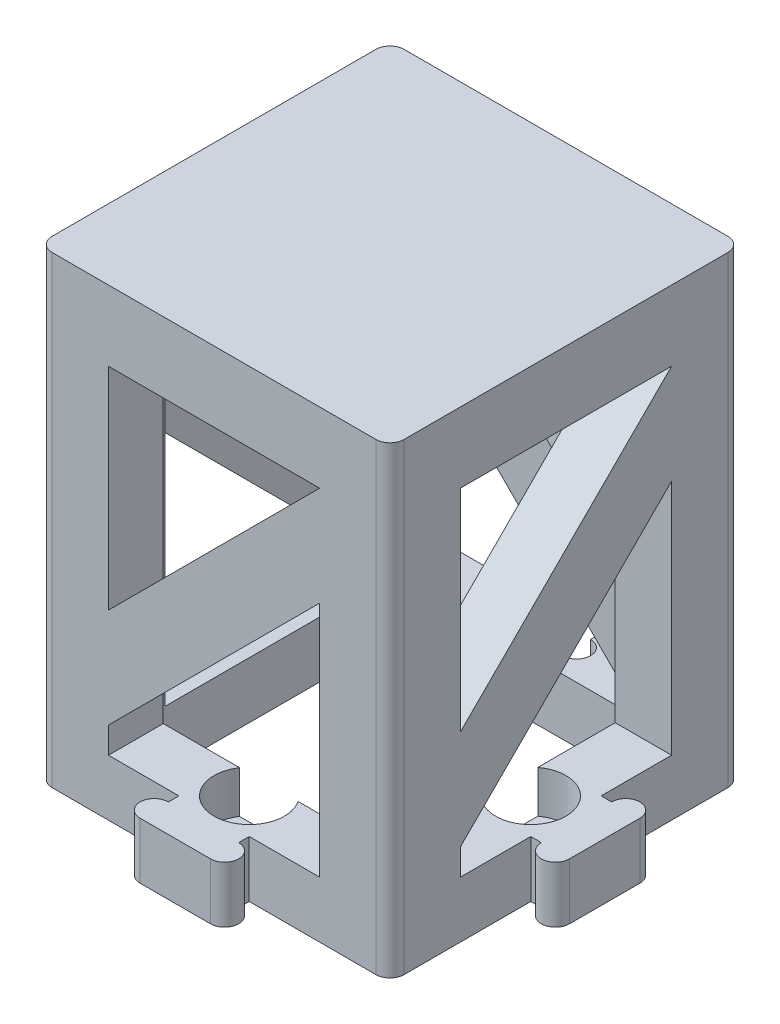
ISO-10303-21;
HEADER;
FILE_DESCRIPTION(('STEP AP214'),'2;1');
FILE_NAME('part.step','',(''),(''),'','','');
FILE_SCHEMA(('AUTOMOTIVE_DESIGN { 1 0 10303 214 1 1 1 1 }'));
ENDSEC;
DATA;
#1=APPLICATION_CONTEXT('core data for automotive mechanical design processes');
#2=APPLICATION_PROTOCOL_DEFINITION('international standard','automotive_design',2000,#1);
#3=PRODUCT_CONTEXT('',#1,'mechanical');
#4=PRODUCT('Part','Part','',(#3));
#5=PRODUCT_RELATED_PRODUCT_CATEGORY('part','',(#4));
#6=PRODUCT_DEFINITION_FORMATION('','',#4);
#7=PRODUCT_DEFINITION_CONTEXT('part definition',#1,'design');
#8=PRODUCT_DEFINITION('design','',#6,#7);
#9=PRODUCT_DEFINITION_SHAPE('','',#8);
#10=(LENGTH_UNIT() NAMED_UNIT(*) SI_UNIT(.MILLI.,.METRE.));
#11=(NAMED_UNIT(*) PLANE_ANGLE_UNIT() SI_UNIT($,.RADIAN.));
#12=(NAMED_UNIT(*) SI_UNIT($,.STERADIAN.) SOLID_ANGLE_UNIT());
#13=UNCERTAINTY_MEASURE_WITH_UNIT(LENGTH_MEASURE(1.E-05),#10,'distance_accuracy_value','');
#14=(GEOMETRIC_REPRESENTATION_CONTEXT(3) GLOBAL_UNCERTAINTY_ASSIGNED_CONTEXT((#13)) GLOBAL_UNIT_ASSIGNED_CONTEXT((#10,
#11,#12)) REPRESENTATION_CONTEXT('',''));
#15=CARTESIAN_POINT('',(0.,0.,0.));
#16=DIRECTION('',(0.,0.,1.));
#17=DIRECTION('',(1.,0.,0.));
#18=AXIS2_PLACEMENT_3D('',#15,#16,#17);
#19=CARTESIAN_POINT('',(-15.,110.,0.));
#20=DIRECTION('',(1.,0.,0.));
#21=DIRECTION('',(0.,0.,-1.));
#22=AXIS2_PLACEMENT_3D('',#19,#20,#21);
#23=PLANE('',#22);
#24=DIRECTION('',(0.,-1.,0.));
#25=VECTOR('',#24,1.);
#26=CARTESIAN_POINT('',(-15.,110.,17.2179144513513));
#27=LINE('',#26,#25);
#28=CARTESIAN_POINT('',(-15.,55.8578643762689,17.2179144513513));
#29=VERTEX_POINT('',#28);
#30=CARTESIAN_POINT('',(-15.,25.8578643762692,17.2179144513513));
#31=VERTEX_POINT('',#30);
#32=EDGE_CURVE('E692',#29,#31,#27,.T.);
#33=ORIENTED_EDGE('',*,*,#32,.F.);
#34=DIRECTION('',(0.,0.,1.));
#35=VECTOR('',#34,1.);
#36=CARTESIAN_POINT('',(-15.,55.8578643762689,0.));
#37=LINE('',#36,#35);
#38=CARTESIAN_POINT('',(-15.,55.8578643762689,25.));
#39=VERTEX_POINT('',#38);
#40=EDGE_CURVE('E129',#29,#39,#37,.T.);
#41=ORIENTED_EDGE('',*,*,#40,.T.);
#42=DIRECTION('',(0.,-1.,0.));
#43=VECTOR('',#42,1.);
#44=CARTESIAN_POINT('',(-15.,110.,25.));
#45=LINE('',#44,#43);
#46=CARTESIAN_POINT('',(-15.,25.8578643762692,25.));
#47=VERTEX_POINT('',#46);
#48=EDGE_CURVE('E1232',#39,#47,#45,.T.);
#49=ORIENTED_EDGE('',*,*,#48,.T.);
#50=DIRECTION('',(0.,0.,1.));
#51=VECTOR('',#50,1.);
#52=CARTESIAN_POINT('',(-15.,25.8578643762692,17.2179144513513));
#53=LINE('',#52,#51);
#54=EDGE_CURVE('E1357',#31,#47,#53,.T.);
#55=ORIENTED_EDGE('',*,*,#54,.F.);
#56=EDGE_LOOP('',(#33,#41,#49,#55));
#57=FACE_BOUND('',#56,.T.);
#58=ADVANCED_FACE('F102',(#57),#23,.T.);
#59=CARTESIAN_POINT('',(0.,110.,-15.));
#60=DIRECTION('',(0.,0.,1.));
#61=DIRECTION('',(1.,0.,0.));
#62=AXIS2_PLACEMENT_3D('',#59,#60,#61);
#63=PLANE('',#62);
#64=DIRECTION('',(0.,-1.,0.));
#65=VECTOR('',#64,1.);
#66=CARTESIAN_POINT('',(-17.2179144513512,110.,-15.0000000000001));
#67=LINE('',#66,#65);
#68=CARTESIAN_POINT('',(-17.2179144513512,55.8578643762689,-15.0000000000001));
#69=VERTEX_POINT('',#68);
#70=CARTESIAN_POINT('',(-17.2179144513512,25.8578643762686,-15.0000000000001));
#71=VERTEX_POINT('',#70);
#72=EDGE_CURVE('E1209',#69,#71,#67,.T.);
#73=ORIENTED_EDGE('',*,*,#72,.F.);
#74=DIRECTION('',(-1.,0.,0.));
#75=VECTOR('',#74,1.);
#76=CARTESIAN_POINT('',(0.,55.8578643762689,-15.));
#77=LINE('',#76,#75);
#78=CARTESIAN_POINT('',(-25.,55.8578643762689,-15.0000000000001));
#79=VERTEX_POINT('',#78);
#80=EDGE_CURVE('E1341',#69,#79,#77,.T.);
#81=ORIENTED_EDGE('',*,*,#80,.T.);
#82=DIRECTION('',(0.,-1.,0.));
#83=VECTOR('',#82,1.);
#84=CARTESIAN_POINT('',(-25.,110.,-15.0000000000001));
#85=LINE('',#84,#83);
#86=CARTESIAN_POINT('',(-25.,25.8578643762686,-15.0000000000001));
#87=VERTEX_POINT('',#86);
#88=EDGE_CURVE('E1213',#79,#87,#85,.T.);
#89=ORIENTED_EDGE('',*,*,#88,.T.);
#90=DIRECTION('',(-1.,0.,0.));
#91=VECTOR('',#90,1.);
#92=CARTESIAN_POINT('',(-17.2179144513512,25.8578643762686,-15.0000000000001));
#93=LINE('',#92,#91);
#94=EDGE_CURVE('E1389',#71,#87,#93,.T.);
#95=ORIENTED_EDGE('',*,*,#94,.F.);
#96=EDGE_LOOP('',(#73,#81,#89,#95));
#97=FACE_BOUND('',#96,.T.);
#98=ADVANCED_FACE('F1723',(#97),#63,.T.);
#99=CARTESIAN_POINT('',(0.,110.,15.));
#100=DIRECTION('',(0.,0.,1.));
#101=DIRECTION('',(1.,0.,0.));
#102=AXIS2_PLACEMENT_3D('',#99,#100,#101);
#103=PLANE('',#102);
#104=DIRECTION('',(-1.,0.,0.));
#105=VECTOR('',#104,1.);
#106=CARTESIAN_POINT('',(0.,55.8578643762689,15.));
#107=LINE('',#106,#105);
#108=CARTESIAN_POINT('',(-17.,55.8578643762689,15.));
#109=VERTEX_POINT('',#108);
#110=CARTESIAN_POINT('',(-17.2179144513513,55.8578643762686,15.));
#111=VERTEX_POINT('',#110);
#112=EDGE_CURVE('E1332',#109,#111,#107,.T.);
#113=ORIENTED_EDGE('',*,*,#112,.F.);
#114=DIRECTION('',(0.,-1.,0.));
#115=VECTOR('',#114,1.);
#116=CARTESIAN_POINT('',(-17.,110.,15.));
#117=LINE('',#116,#115);
#118=CARTESIAN_POINT('',(-17.,8.,15.));
#119=VERTEX_POINT('',#118);
#120=EDGE_CURVE('E1238',#109,#119,#117,.T.);
#121=ORIENTED_EDGE('',*,*,#120,.T.);
#122=DIRECTION('',(-1.,0.,0.));
#123=VECTOR('',#122,1.);
#124=CARTESIAN_POINT('',(0.,8.,15.));
#125=LINE('',#124,#123);
#126=CARTESIAN_POINT('',(-25.,8.,15.));
#127=VERTEX_POINT('',#126);
#128=EDGE_CURVE('E1227',#119,#127,#125,.T.);
#129=ORIENTED_EDGE('',*,*,#128,.T.);
#130=DIRECTION('',(0.,-1.,0.));
#131=VECTOR('',#130,1.);
#132=CARTESIAN_POINT('',(-25.,110.,15.));
#133=LINE('',#132,#131);
#134=CARTESIAN_POINT('',(-25.0000000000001,41.7157287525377,15.));
#135=VERTEX_POINT('',#134);
#136=EDGE_CURVE('E1235',#135,#127,#133,.T.);
#137=ORIENTED_EDGE('',*,*,#136,.F.);
#138=DIRECTION('',(-1.,0.,0.));
#139=VECTOR('',#138,1.);
#140=CARTESIAN_POINT('',(-17.2179144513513,41.7157287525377,15.));
#141=LINE('',#140,#139);
#142=CARTESIAN_POINT('',(-17.2179144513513,41.7157287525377,15.));
#143=VERTEX_POINT('',#142);
#144=EDGE_CURVE('E1399',#143,#135,#141,.T.);
#145=ORIENTED_EDGE('',*,*,#144,.F.);
#146=DIRECTION('',(0.,1.,0.));
#147=VECTOR('',#146,1.);
#148=CARTESIAN_POINT('',(-17.2179144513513,0.,15.));
#149=LINE('',#148,#147);
#150=EDGE_CURVE('E1393',#143,#111,#149,.T.);
#151=ORIENTED_EDGE('',*,*,#150,.T.);
#152=EDGE_LOOP('',(#113,#121,#129,#137,#145,#151));
#153=FACE_BOUND('',#152,.T.);
#154=ADVANCED_FACE('F1724',(#153),#103,.F.);
#155=CARTESIAN_POINT('',(15.,110.,0.));
#156=DIRECTION('',(-1.,0.,0.));
#157=DIRECTION('',(0.,0.,1.));
#158=AXIS2_PLACEMENT_3D('',#155,#156,#157);
#159=PLANE('',#158);
#160=DIRECTION('',(0.,-1.,0.));
#161=VECTOR('',#160,1.);
#162=CARTESIAN_POINT('',(15.,110.,-17.2179144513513));
#163=LINE('',#162,#161);
#164=CARTESIAN_POINT('',(15.,55.8578643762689,-17.2179144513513));
#165=VERTEX_POINT('',#164);
#166=CARTESIAN_POINT('',(15.0000000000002,25.8578643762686,-17.2179144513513));
#167=VERTEX_POINT('',#166);
#168=EDGE_CURVE('E1154',#165,#167,#163,.T.);
#169=ORIENTED_EDGE('',*,*,#168,.F.);
#170=DIRECTION('',(0.,0.,-1.));
#171=VECTOR('',#170,1.);
#172=CARTESIAN_POINT('',(15.,55.8578643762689,0.));
#173=LINE('',#172,#171);
#174=CARTESIAN_POINT('',(15.0000000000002,55.8578643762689,-25.));
#175=VERTEX_POINT('',#174);
#176=EDGE_CURVE('E1353',#165,#175,#173,.T.);
#177=ORIENTED_EDGE('',*,*,#176,.T.);
#178=DIRECTION('',(0.,-1.,0.));
#179=VECTOR('',#178,1.);
#180=CARTESIAN_POINT('',(15.0000000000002,110.,-25.));
#181=LINE('',#180,#179);
#182=CARTESIAN_POINT('',(15.0000000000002,25.8578643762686,-25.));
#183=VERTEX_POINT('',#182);
#184=EDGE_CURVE('E1183',#175,#183,#181,.T.);
#185=ORIENTED_EDGE('',*,*,#184,.T.);
#186=DIRECTION('',(0.,0.,-1.));
#187=VECTOR('',#186,1.);
#188=CARTESIAN_POINT('',(15.0000000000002,25.8578643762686,-17.2179144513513));
#189=LINE('',#188,#187);
#190=EDGE_CURVE('E1441',#167,#183,#189,.T.);
#191=ORIENTED_EDGE('',*,*,#190,.F.);
#192=EDGE_LOOP('',(#169,#177,#185,#191));
#193=FACE_BOUND('',#192,.T.);
#194=ADVANCED_FACE('F1727',(#193),#159,.T.);
#195=CARTESIAN_POINT('',(-1.40434820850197E-13,110.,15.));
#196=DIRECTION('',(0.,0.,-1.));
#197=DIRECTION('',(-1.,0.,0.));
#198=AXIS2_PLACEMENT_3D('',#195,#196,#197);
#199=PLANE('',#198);
#200=DIRECTION('',(0.,-1.,0.));
#201=VECTOR('',#200,1.);
#202=CARTESIAN_POINT('',(17.2179144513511,110.,15.0000000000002));
#203=LINE('',#202,#201);
#204=CARTESIAN_POINT('',(17.2179144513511,55.8578643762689,15.0000000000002));
#205=VERTEX_POINT('',#204);
#206=CARTESIAN_POINT('',(17.2179144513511,25.8578643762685,15.0000000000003));
#207=VERTEX_POINT('',#206);
#208=EDGE_CURVE('E1158',#205,#207,#203,.T.);
#209=ORIENTED_EDGE('',*,*,#208,.F.);
#210=DIRECTION('',(1.,0.,0.));
#211=VECTOR('',#210,1.);
#212=CARTESIAN_POINT('',(-1.40434820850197E-13,55.8578643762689,15.));
#213=LINE('',#212,#211);
#214=CARTESIAN_POINT('',(25.,55.8578643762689,15.0000000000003));
#215=VERTEX_POINT('',#214);
#216=EDGE_CURVE('E1818',#205,#215,#213,.T.);
#217=ORIENTED_EDGE('',*,*,#216,.T.);
#218=DIRECTION('',(0.,-1.,0.));
#219=VECTOR('',#218,1.);
#220=CARTESIAN_POINT('',(25.,110.,15.0000000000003));
#221=LINE('',#220,#219);
#222=CARTESIAN_POINT('',(25.,25.8578643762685,15.0000000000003));
#223=VERTEX_POINT('',#222);
#224=EDGE_CURVE('E1162',#215,#223,#221,.T.);
#225=ORIENTED_EDGE('',*,*,#224,.T.);
#226=DIRECTION('',(1.,0.,0.));
#227=VECTOR('',#226,1.);
#228=CARTESIAN_POINT('',(17.2179144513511,25.8578643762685,15.0000000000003));
#229=LINE('',#228,#227);
#230=EDGE_CURVE('E1460',#207,#223,#229,.T.);
#231=ORIENTED_EDGE('',*,*,#230,.F.);
#232=EDGE_LOOP('',(#209,#217,#225,#231));
#233=FACE_BOUND('',#232,.T.);
#234=ADVANCED_FACE('F1745',(#233),#199,.T.);
#235=CARTESIAN_POINT('',(1.13841228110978E-13,110.,-15.));
#236=DIRECTION('',(0.,0.,-1.));
#237=DIRECTION('',(-1.,0.,0.));
#238=AXIS2_PLACEMENT_3D('',#235,#236,#237);
#239=PLANE('',#238);
#240=DIRECTION('',(1.,0.,0.));
#241=VECTOR('',#240,1.);
#242=CARTESIAN_POINT('',(1.13841228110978E-13,55.8578643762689,-15.));
#243=LINE('',#242,#241);
#244=CARTESIAN_POINT('',(17.,55.8578643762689,-14.9999999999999));
#245=VERTEX_POINT('',#244);
#246=CARTESIAN_POINT('',(17.2179144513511,55.8578643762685,-14.9999999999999));
#247=VERTEX_POINT('',#246);
#248=EDGE_CURVE('E1344',#245,#247,#243,.T.);
#249=ORIENTED_EDGE('',*,*,#248,.F.);
#250=DIRECTION('',(0.,-1.,0.));
#251=VECTOR('',#250,1.);
#252=CARTESIAN_POINT('',(17.,110.,-14.9999999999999));
#253=LINE('',#252,#251);
#254=CARTESIAN_POINT('',(17.,8.,-14.9999999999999));
#255=VERTEX_POINT('',#254);
#256=EDGE_CURVE('E1189',#245,#255,#253,.T.);
#257=ORIENTED_EDGE('',*,*,#256,.T.);
#258=DIRECTION('',(1.,0.,0.));
#259=VECTOR('',#258,1.);
#260=CARTESIAN_POINT('',(1.13841228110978E-13,8.,-15.));
#261=LINE('',#260,#259);
#262=CARTESIAN_POINT('',(25.,8.,-14.9999999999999));
#263=VERTEX_POINT('',#262);
#264=EDGE_CURVE('E1177',#255,#263,#261,.T.);
#265=ORIENTED_EDGE('',*,*,#264,.T.);
#266=DIRECTION('',(0.,-1.,0.));
#267=VECTOR('',#266,1.);
#268=CARTESIAN_POINT('',(25.,110.,-14.9999999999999));
#269=LINE('',#268,#267);
#270=CARTESIAN_POINT('',(25.,41.7157287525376,-14.9999999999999));
#271=VERTEX_POINT('',#270);
#272=EDGE_CURVE('E1186',#271,#263,#269,.T.);
#273=ORIENTED_EDGE('',*,*,#272,.F.);
#274=DIRECTION('',(1.,0.,0.));
#275=VECTOR('',#274,1.);
#276=CARTESIAN_POINT('',(17.2179144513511,41.7157287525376,-14.9999999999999));
#277=LINE('',#276,#275);
#278=CARTESIAN_POINT('',(17.2179144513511,41.7157287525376,-14.9999999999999));
#279=VERTEX_POINT('',#278);
#280=EDGE_CURVE('E1470',#279,#271,#277,.T.);
#281=ORIENTED_EDGE('',*,*,#280,.F.);
#282=DIRECTION('',(0.,1.,0.));
#283=VECTOR('',#282,1.);
#284=CARTESIAN_POINT('',(17.2179144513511,0.,-14.9999999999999));
#285=LINE('',#284,#283);
#286=EDGE_CURVE('E1464',#279,#247,#285,.T.);
#287=ORIENTED_EDGE('',*,*,#286,.T.);
#288=EDGE_LOOP('',(#249,#257,#265,#273,#281,#287));
#289=FACE_BOUND('',#288,.T.);
#290=ADVANCED_FACE('F1689',(#289),#239,.F.);
#291=CARTESIAN_POINT('',(15.,8.,15.2179144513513));
#292=DIRECTION('',(0.,-1.,0.));
#293=DIRECTION('',(0.,0.,-1.));
#294=AXIS2_PLACEMENT_3D('',#291,#292,#293);
#295=CYLINDRICAL_SURFACE('',#294,2.);
#296=DIRECTION('',(0.,1.,0.));
#297=VECTOR('',#296,1.);
#298=CARTESIAN_POINT('',(14.9999999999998,0.,17.2179144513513));
#299=LINE('',#298,#297);
#300=CARTESIAN_POINT('',(14.9999999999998,41.7157287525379,17.2179144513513));
#301=VERTEX_POINT('',#300);
#302=CARTESIAN_POINT('',(14.9999999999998,55.8578643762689,17.2179144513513));
#303=VERTEX_POINT('',#302);
#304=EDGE_CURVE('E1361',#301,#303,#299,.T.);
#305=ORIENTED_EDGE('',*,*,#304,.T.);
#306=CARTESIAN_POINT('',(15.,55.8578643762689,15.2179144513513));
#307=DIRECTION('',(0.,1.,0.));
#308=DIRECTION('',(0.,0.,1.));
#309=AXIS2_PLACEMENT_3D('',#306,#307,#308);
#310=CIRCLE('',#309,2.);
#311=CARTESIAN_POINT('',(16.5189672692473,55.8578643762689,16.5189672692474));
#312=VERTEX_POINT('',#311);
#313=EDGE_CURVE('E1804',#303,#312,#310,.T.);
#314=ORIENTED_EDGE('',*,*,#313,.T.);
#315=DIRECTION('',(0.,-1.,0.));
#316=VECTOR('',#315,1.);
#317=CARTESIAN_POINT('',(16.5189672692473,110.,16.5189672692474));
#318=LINE('',#317,#316);
#319=CARTESIAN_POINT('',(16.5189672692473,8.,16.5189672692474));
#320=VERTEX_POINT('',#319);
#321=EDGE_CURVE('E1169',#312,#320,#318,.T.);
#322=ORIENTED_EDGE('',*,*,#321,.T.);
#323=CARTESIAN_POINT('',(15.,8.,15.2179144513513));
#324=DIRECTION('',(0.,1.,0.));
#325=DIRECTION('',(0.,0.,1.));
#326=AXIS2_PLACEMENT_3D('',#323,#324,#325);
#327=CIRCLE('',#326,2.);
#328=CARTESIAN_POINT('',(17.,8.,15.2179144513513));
#329=VERTEX_POINT('',#328);
#330=EDGE_CURVE('E750',#320,#329,#327,.T.);
#331=ORIENTED_EDGE('',*,*,#330,.T.);
#332=DIRECTION('',(0.,-1.,0.));
#333=VECTOR('',#332,1.);
#334=CARTESIAN_POINT('',(17.,8.,15.2179144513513));
#335=LINE('',#334,#333);
#336=CARTESIAN_POINT('',(17.,0.,15.2179144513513));
#337=VERTEX_POINT('',#336);
#338=EDGE_CURVE('E672',#329,#337,#335,.T.);
#339=ORIENTED_EDGE('',*,*,#338,.T.);
#340=CARTESIAN_POINT('',(15.,0.,15.2179144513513));
#341=DIRECTION('',(0.,1.,0.));
#342=DIRECTION('',(0.,0.,1.));
#343=AXIS2_PLACEMENT_3D('',#340,#341,#342);
#344=CIRCLE('',#343,2.);
#345=CARTESIAN_POINT('',(15.,0.,17.2179144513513));
#346=VERTEX_POINT('',#345);
#347=EDGE_CURVE('E879',#346,#337,#344,.T.);
#348=ORIENTED_EDGE('',*,*,#347,.F.);
#349=DIRECTION('',(0.,-1.,0.));
#350=VECTOR('',#349,1.);
#351=CARTESIAN_POINT('',(15.,8.,17.2179144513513));
#352=LINE('',#351,#350);
#353=CARTESIAN_POINT('',(15.,8.,17.2179144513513));
#354=VERTEX_POINT('',#353);
#355=EDGE_CURVE('E669',#354,#346,#352,.T.);
#356=ORIENTED_EDGE('',*,*,#355,.F.);
#357=DIRECTION('',(0.,-1.,0.));
#358=VECTOR('',#357,1.);
#359=CARTESIAN_POINT('',(15.,110.,17.2179144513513));
#360=LINE('',#359,#358);
#361=EDGE_CURVE('E1143',#301,#354,#360,.T.);
#362=ORIENTED_EDGE('',*,*,#361,.F.);
#363=EDGE_LOOP('',(#305,#314,#322,#331,#339,#348,#356,#362));
#364=FACE_BOUND('',#363,.T.);
#365=ADVANCED_FACE('F1277',(#364),#295,.F.);
#366=CARTESIAN_POINT('',(-15.,8.,15.2179144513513));
#367=DIRECTION('',(0.,-1.,0.));
#368=DIRECTION('',(0.,0.,-1.));
#369=AXIS2_PLACEMENT_3D('',#366,#367,#368);
#370=CYLINDRICAL_SURFACE('',#369,2.);
#371=CARTESIAN_POINT('',(-15.,55.8578643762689,15.2179144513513));
#372=DIRECTION('',(0.,1.,0.));
#373=DIRECTION('',(0.,0.,1.));
#374=AXIS2_PLACEMENT_3D('',#371,#372,#373);
#375=CIRCLE('',#374,2.);
#376=CARTESIAN_POINT('',(-17.,55.8578643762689,15.2179144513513));
#377=VERTEX_POINT('',#376);
#378=EDGE_CURVE('E1318',#29,#377,#375,.F.);
#379=ORIENTED_EDGE('',*,*,#378,.F.);
#380=ORIENTED_EDGE('',*,*,#32,.T.);
#381=DIRECTION('',(0.,1.,0.));
#382=VECTOR('',#381,1.);
#383=CARTESIAN_POINT('',(-15.,0.,17.2179144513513));
#384=LINE('',#383,#382);
#385=CARTESIAN_POINT('',(-15.,11.7157287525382,17.2179144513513));
#386=VERTEX_POINT('',#385);
#387=EDGE_CURVE('E1250',#386,#31,#384,.T.);
#388=ORIENTED_EDGE('',*,*,#387,.F.);
#389=CARTESIAN_POINT('',(-15.,8.,17.2179144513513));
#390=VERTEX_POINT('',#389);
#391=EDGE_CURVE('E1240',#386,#390,#27,.T.);
#392=ORIENTED_EDGE('',*,*,#391,.T.);
#393=DIRECTION('',(0.,-1.,0.));
#394=VECTOR('',#393,1.);
#395=CARTESIAN_POINT('',(-15.,8.,17.2179144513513));
#396=LINE('',#395,#394);
#397=CARTESIAN_POINT('',(-15.,0.,17.2179144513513));
#398=VERTEX_POINT('',#397);
#399=EDGE_CURVE('E659',#390,#398,#396,.T.);
#400=ORIENTED_EDGE('',*,*,#399,.T.);
#401=CARTESIAN_POINT('',(-15.,0.,15.2179144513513));
#402=DIRECTION('',(0.,1.,0.));
#403=DIRECTION('',(0.,0.,1.));
#404=AXIS2_PLACEMENT_3D('',#401,#402,#403);
#405=CIRCLE('',#404,2.);
#406=CARTESIAN_POINT('',(-17.,0.,15.2179144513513));
#407=VERTEX_POINT('',#406);
#408=EDGE_CURVE('E895',#398,#407,#405,.F.);
#409=ORIENTED_EDGE('',*,*,#408,.T.);
#410=DIRECTION('',(0.,-1.,0.));
#411=VECTOR('',#410,1.);
#412=CARTESIAN_POINT('',(-17.,8.,15.2179144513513));
#413=LINE('',#412,#411);
#414=EDGE_CURVE('E656',#377,#407,#413,.T.);
#415=ORIENTED_EDGE('',*,*,#414,.F.);
#416=EDGE_LOOP('',(#379,#380,#388,#392,#400,#409,#415));
#417=FACE_BOUND('',#416,.T.);
#418=ADVANCED_FACE('F1248',(#417),#370,.F.);
#419=CARTESIAN_POINT('',(-17.,8.,0.));
#420=DIRECTION('',(-1.,0.,0.));
#421=DIRECTION('',(0.,0.,1.));
#422=AXIS2_PLACEMENT_3D('',#419,#420,#421);
#423=PLANE('',#422);
#424=DIRECTION('',(0.,0.,-1.));
#425=VECTOR('',#424,1.);
#426=CARTESIAN_POINT('',(-17.,55.8578643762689,0.));
#427=LINE('',#426,#425);
#428=EDGE_CURVE('E1324',#377,#109,#427,.T.);
#429=ORIENTED_EDGE('',*,*,#428,.F.);
#430=ORIENTED_EDGE('',*,*,#414,.T.);
#431=DIRECTION('',(0.,0.,-1.));
#432=VECTOR('',#431,1.);
#433=CARTESIAN_POINT('',(-17.,0.,0.));
#434=LINE('',#433,#432);
#435=CARTESIAN_POINT('',(-17.,0.,-15.2179144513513));
#436=VERTEX_POINT('',#435);
#437=EDGE_CURVE('E899',#407,#436,#434,.T.);
#438=ORIENTED_EDGE('',*,*,#437,.T.);
#439=DIRECTION('',(0.,-1.,0.));
#440=VECTOR('',#439,1.);
#441=CARTESIAN_POINT('',(-17.,8.,-15.2179144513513));
#442=LINE('',#441,#440);
#443=CARTESIAN_POINT('',(-17.,8.,-15.2179144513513));
#444=VERTEX_POINT('',#443);
#445=EDGE_CURVE('E653',#444,#436,#442,.T.);
#446=ORIENTED_EDGE('',*,*,#445,.F.);
#447=DIRECTION('',(0.,0.,-1.));
#448=VECTOR('',#447,1.);
#449=CARTESIAN_POINT('',(-17.,8.,0.));
#450=LINE('',#449,#448);
#451=EDGE_CURVE('E762',#119,#444,#450,.T.);
#452=ORIENTED_EDGE('',*,*,#451,.F.);
#453=ORIENTED_EDGE('',*,*,#120,.F.);
#454=EDGE_LOOP('',(#429,#430,#438,#446,#452,#453));
#455=FACE_BOUND('',#454,.T.);
#456=ADVANCED_FACE('F1315',(#455),#423,.F.);
#457=CARTESIAN_POINT('',(-15.,8.,-15.2179144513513));
#458=DIRECTION('',(0.,-1.,0.));
#459=DIRECTION('',(0.,0.,-1.));
#460=AXIS2_PLACEMENT_3D('',#457,#458,#459);
#461=CYLINDRICAL_SURFACE('',#460,2.);
#462=DIRECTION('',(0.,1.,0.));
#463=VECTOR('',#462,1.);
#464=CARTESIAN_POINT('',(-14.9999999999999,0.,-17.2179144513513));
#465=LINE('',#464,#463);
#466=CARTESIAN_POINT('',(-14.9999999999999,41.7157287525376,-17.2179144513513));
#467=VERTEX_POINT('',#466);
#468=CARTESIAN_POINT('',(-14.9999999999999,55.8578643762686,-17.2179144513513));
#469=VERTEX_POINT('',#468);
#470=EDGE_CURVE('E1438',#467,#469,#465,.T.);
#471=ORIENTED_EDGE('',*,*,#470,.T.);
#472=CARTESIAN_POINT('',(-15.,55.8578643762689,-15.2179144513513));
#473=DIRECTION('',(0.,1.,0.));
#474=DIRECTION('',(0.,0.,1.));
#475=AXIS2_PLACEMENT_3D('',#472,#473,#474);
#476=CIRCLE('',#475,2.);
#477=CARTESIAN_POINT('',(-16.5189672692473,55.8578643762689,-16.5189672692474));
#478=VERTEX_POINT('',#477);
#479=EDGE_CURVE('E1330',#469,#478,#476,.T.);
#480=ORIENTED_EDGE('',*,*,#479,.T.);
#481=DIRECTION('',(0.,-1.,0.));
#482=VECTOR('',#481,1.);
#483=CARTESIAN_POINT('',(-16.5189672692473,110.,-16.5189672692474));
#484=LINE('',#483,#482);
#485=CARTESIAN_POINT('',(-16.5189672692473,8.,-16.5189672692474));
#486=VERTEX_POINT('',#485);
#487=EDGE_CURVE('E1178',#478,#486,#484,.T.);
#488=ORIENTED_EDGE('',*,*,#487,.T.);
#489=CARTESIAN_POINT('',(-15.,8.,-15.2179144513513));
#490=DIRECTION('',(0.,1.,0.));
#491=DIRECTION('',(0.,0.,1.));
#492=AXIS2_PLACEMENT_3D('',#489,#490,#491);
#493=CIRCLE('',#492,2.);
#494=EDGE_CURVE('E766',#486,#444,#493,.T.);
#495=ORIENTED_EDGE('',*,*,#494,.T.);
#496=ORIENTED_EDGE('',*,*,#445,.T.);
#497=CARTESIAN_POINT('',(-15.,0.,-15.2179144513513));
#498=DIRECTION('',(0.,1.,0.));
#499=DIRECTION('',(0.,0.,1.));
#500=AXIS2_PLACEMENT_3D('',#497,#498,#499);
#501=CIRCLE('',#500,2.);
#502=CARTESIAN_POINT('',(-15.,0.,-17.2179144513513));
#503=VERTEX_POINT('',#502);
#504=EDGE_CURVE('E903',#503,#436,#501,.T.);
#505=ORIENTED_EDGE('',*,*,#504,.F.);
#506=DIRECTION('',(0.,-1.,0.));
#507=VECTOR('',#506,1.);
#508=CARTESIAN_POINT('',(-15.,8.,-17.2179144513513));
#509=LINE('',#508,#507);
#510=CARTESIAN_POINT('',(-15.,8.,-17.2179144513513));
#511=VERTEX_POINT('',#510);
#512=EDGE_CURVE('E650',#511,#503,#509,.T.);
#513=ORIENTED_EDGE('',*,*,#512,.F.);
#514=DIRECTION('',(0.,-1.,0.));
#515=VECTOR('',#514,1.);
#516=CARTESIAN_POINT('',(-15.,110.,-17.2179144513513));
#517=LINE('',#516,#515);
#518=EDGE_CURVE('E1219',#467,#511,#517,.T.);
#519=ORIENTED_EDGE('',*,*,#518,.F.);
#520=EDGE_LOOP('',(#471,#480,#488,#495,#496,#505,#513,#519));
#521=FACE_BOUND('',#520,.T.);
#522=ADVANCED_FACE('F1310',(#521),#461,.F.);
#523=CARTESIAN_POINT('',(15.,8.,-15.2179144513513));
#524=DIRECTION('',(0.,-1.,0.));
#525=DIRECTION('',(0.,0.,-1.));
#526=AXIS2_PLACEMENT_3D('',#523,#524,#525);
#527=CYLINDRICAL_SURFACE('',#526,2.);
#528=DIRECTION('',(0.,-1.,0.));
#529=VECTOR('',#528,1.);
#530=CARTESIAN_POINT('',(17.,8.,-15.2179144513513));
#531=LINE('',#530,#529);
#532=CARTESIAN_POINT('',(17.,55.8578643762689,-15.2179144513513));
#533=VERTEX_POINT('',#532);
#534=CARTESIAN_POINT('',(17.,0.,-15.2179144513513));
#535=VERTEX_POINT('',#534);
#536=EDGE_CURVE('E643',#533,#535,#531,.T.);
#537=ORIENTED_EDGE('',*,*,#536,.F.);
#538=CARTESIAN_POINT('',(15.,55.8578643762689,-15.2179144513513));
#539=DIRECTION('',(0.,1.,0.));
#540=DIRECTION('',(0.,0.,1.));
#541=AXIS2_PLACEMENT_3D('',#538,#539,#540);
#542=CIRCLE('',#541,2.);
#543=EDGE_CURVE('E1350',#533,#165,#542,.T.);
#544=ORIENTED_EDGE('',*,*,#543,.T.);
#545=ORIENTED_EDGE('',*,*,#168,.T.);
#546=DIRECTION('',(0.,1.,0.));
#547=VECTOR('',#546,1.);
#548=CARTESIAN_POINT('',(15.0000000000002,0.,-17.2179144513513));
#549=LINE('',#548,#547);
#550=CARTESIAN_POINT('',(15.,11.7157287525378,-17.2179144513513));
#551=VERTEX_POINT('',#550);
#552=EDGE_CURVE('E1428',#551,#167,#549,.T.);
#553=ORIENTED_EDGE('',*,*,#552,.F.);
#554=CARTESIAN_POINT('',(15.,8.,-17.2179144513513));
#555=VERTEX_POINT('',#554);
#556=EDGE_CURVE('E1192',#551,#555,#163,.T.);
#557=ORIENTED_EDGE('',*,*,#556,.T.);
#558=DIRECTION('',(0.,-1.,0.));
#559=VECTOR('',#558,1.);
#560=CARTESIAN_POINT('',(15.,8.,-17.2179144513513));
#561=LINE('',#560,#559);
#562=CARTESIAN_POINT('',(15.,0.,-17.2179144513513));
#563=VERTEX_POINT('',#562);
#564=EDGE_CURVE('E647',#555,#563,#561,.T.);
#565=ORIENTED_EDGE('',*,*,#564,.T.);
#566=CARTESIAN_POINT('',(15.,0.,-15.2179144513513));
#567=DIRECTION('',(0.,1.,0.));
#568=DIRECTION('',(0.,0.,1.));
#569=AXIS2_PLACEMENT_3D('',#566,#567,#568);
#570=CIRCLE('',#569,2.);
#571=EDGE_CURVE('E911',#535,#563,#570,.T.);
#572=ORIENTED_EDGE('',*,*,#571,.F.);
#573=EDGE_LOOP('',(#537,#544,#545,#553,#557,#565,#572));
#574=FACE_BOUND('',#573,.T.);
#575=ADVANCED_FACE('F1299',(#574),#527,.F.);
#576=CARTESIAN_POINT('',(17.,8.,0.));
#577=DIRECTION('',(-1.,0.,0.));
#578=DIRECTION('',(0.,0.,1.));
#579=AXIS2_PLACEMENT_3D('',#576,#577,#578);
#580=PLANE('',#579);
#581=ORIENTED_EDGE('',*,*,#256,.F.);
#582=DIRECTION('',(0.,0.,-1.));
#583=VECTOR('',#582,1.);
#584=CARTESIAN_POINT('',(17.,55.8578643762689,0.));
#585=LINE('',#584,#583);
#586=EDGE_CURVE('E1296',#245,#533,#585,.T.);
#587=ORIENTED_EDGE('',*,*,#586,.T.);
#588=ORIENTED_EDGE('',*,*,#536,.T.);
#589=DIRECTION('',(0.,0.,-1.));
#590=VECTOR('',#589,1.);
#591=CARTESIAN_POINT('',(17.,0.,0.));
#592=LINE('',#591,#590);
#593=CARTESIAN_POINT('',(17.,0.,-1.24999999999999));
#594=VERTEX_POINT('',#593);
#595=EDGE_CURVE('E915',#594,#535,#592,.T.);
#596=ORIENTED_EDGE('',*,*,#595,.F.);
#597=DIRECTION('',(0.,-1.,0.));
#598=VECTOR('',#597,1.);
#599=CARTESIAN_POINT('',(17.,8.,-1.24999999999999));
#600=LINE('',#599,#598);
#601=CARTESIAN_POINT('',(17.,2.,-1.24999999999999));
#602=VERTEX_POINT('',#601);
#603=EDGE_CURVE('E640',#602,#594,#600,.T.);
#604=ORIENTED_EDGE('',*,*,#603,.F.);
#605=DIRECTION('',(0.,0.,-1.));
#606=VECTOR('',#605,1.);
#607=CARTESIAN_POINT('',(17.,2.,0.));
#608=LINE('',#607,#606);
#609=CARTESIAN_POINT('',(17.,2.,-3.99999999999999));
#610=VERTEX_POINT('',#609);
#611=EDGE_CURVE('E113',#602,#610,#608,.T.);
#612=ORIENTED_EDGE('',*,*,#611,.T.);
#613=DIRECTION('',(0.,1.,0.));
#614=VECTOR('',#613,1.);
#615=CARTESIAN_POINT('',(17.,2.,-3.99999999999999));
#616=LINE('',#615,#614);
#617=CARTESIAN_POINT('',(17.,8.,-3.99999999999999));
#618=VERTEX_POINT('',#617);
#619=EDGE_CURVE('E713',#618,#610,#616,.F.);
#620=ORIENTED_EDGE('',*,*,#619,.F.);
#621=DIRECTION('',(0.,0.,-1.));
#622=VECTOR('',#621,1.);
#623=CARTESIAN_POINT('',(17.,8.,0.));
#624=LINE('',#623,#622);
#625=EDGE_CURVE('E773',#618,#255,#624,.T.);
#626=ORIENTED_EDGE('',*,*,#625,.T.);
#627=EDGE_LOOP('',(#581,#587,#588,#596,#604,#612,#620,#626));
#628=FACE_BOUND('',#627,.T.);
#629=ADVANCED_FACE('F1292',(#628),#580,.T.);
#630=CARTESIAN_POINT('',(15.2179144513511,110.,15.0000000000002));
#631=DIRECTION('',(0.,-1.,0.));
#632=DIRECTION('',(0.,0.,-1.));
#633=AXIS2_PLACEMENT_3D('',#630,#631,#632);
#634=CYLINDRICAL_SURFACE('',#633,2.);
#635=ORIENTED_EDGE('',*,*,#321,.F.);
#636=CARTESIAN_POINT('',(15.2179144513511,55.8578643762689,15.0000000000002));
#637=DIRECTION('',(0.,1.,0.));
#638=DIRECTION('',(0.,0.,1.));
#639=AXIS2_PLACEMENT_3D('',#636,#637,#638);
#640=CIRCLE('',#639,2.);
#641=EDGE_CURVE('E1809',#312,#205,#640,.T.);
#642=ORIENTED_EDGE('',*,*,#641,.T.);
#643=ORIENTED_EDGE('',*,*,#208,.T.);
#644=DIRECTION('',(0.,1.,0.));
#645=VECTOR('',#644,1.);
#646=CARTESIAN_POINT('',(17.2179144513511,0.,15.0000000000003));
#647=LINE('',#646,#645);
#648=CARTESIAN_POINT('',(17.2179144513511,11.7157287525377,15.0000000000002));
#649=VERTEX_POINT('',#648);
#650=EDGE_CURVE('E1479',#649,#207,#647,.T.);
#651=ORIENTED_EDGE('',*,*,#650,.F.);
#652=CARTESIAN_POINT('',(17.2179144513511,8.,15.0000000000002));
#653=VERTEX_POINT('',#652);
#654=EDGE_CURVE('E1151',#649,#653,#203,.T.);
#655=ORIENTED_EDGE('',*,*,#654,.T.);
#656=CARTESIAN_POINT('',(15.2179144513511,8.,15.0000000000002));
#657=DIRECTION('',(0.,1.,0.));
#658=DIRECTION('',(0.,0.,1.));
#659=AXIS2_PLACEMENT_3D('',#656,#657,#658);
#660=CIRCLE('',#659,2.);
#661=EDGE_CURVE('E1146',#320,#653,#660,.T.);
#662=ORIENTED_EDGE('',*,*,#661,.F.);
#663=EDGE_LOOP('',(#635,#642,#643,#651,#655,#662));
#664=FACE_BOUND('',#663,.T.);
#665=ADVANCED_FACE('F1669',(#664),#634,.F.);
#666=CARTESIAN_POINT('',(-15.2179144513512,110.,-15.0000000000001));
#667=DIRECTION('',(0.,-1.,0.));
#668=DIRECTION('',(0.,0.,-1.));
#669=AXIS2_PLACEMENT_3D('',#666,#667,#668);
#670=CYLINDRICAL_SURFACE('',#669,2.);
#671=ORIENTED_EDGE('',*,*,#487,.F.);
#672=CARTESIAN_POINT('',(-15.2179144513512,55.8578643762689,-15.0000000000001));
#673=DIRECTION('',(0.,1.,0.));
#674=DIRECTION('',(0.,0.,1.));
#675=AXIS2_PLACEMENT_3D('',#672,#673,#674);
#676=CIRCLE('',#675,2.);
#677=EDGE_CURVE('E1338',#478,#69,#676,.T.);
#678=ORIENTED_EDGE('',*,*,#677,.T.);
#679=ORIENTED_EDGE('',*,*,#72,.T.);
#680=DIRECTION('',(0.,1.,0.));
#681=VECTOR('',#680,1.);
#682=CARTESIAN_POINT('',(-17.2179144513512,0.,-15.0000000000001));
#683=LINE('',#682,#681);
#684=CARTESIAN_POINT('',(-17.2179144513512,11.7157287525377,-15.0000000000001));
#685=VERTEX_POINT('',#684);
#686=EDGE_CURVE('E1408',#685,#71,#683,.T.);
#687=ORIENTED_EDGE('',*,*,#686,.F.);
#688=CARTESIAN_POINT('',(-17.2179144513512,8.,-15.0000000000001));
#689=VERTEX_POINT('',#688);
#690=EDGE_CURVE('E1208',#685,#689,#67,.T.);
#691=ORIENTED_EDGE('',*,*,#690,.T.);
#692=CARTESIAN_POINT('',(-15.2179144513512,8.,-15.0000000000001));
#693=DIRECTION('',(0.,1.,0.));
#694=DIRECTION('',(0.,0.,1.));
#695=AXIS2_PLACEMENT_3D('',#692,#693,#694);
#696=CIRCLE('',#695,2.);
#697=EDGE_CURVE('E1195',#486,#689,#696,.T.);
#698=ORIENTED_EDGE('',*,*,#697,.F.);
#699=EDGE_LOOP('',(#671,#678,#679,#687,#691,#698));
#700=FACE_BOUND('',#699,.T.);
#701=ADVANCED_FACE('F1729',(#700),#670,.F.);
#702=DIRECTION('',(0.,0.,1.));
#703=VECTOR('',#702,1.);
#704=CARTESIAN_POINT('',(-15.,11.7157287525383,17.2179144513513));
#705=LINE('',#704,#703);
#706=CARTESIAN_POINT('',(-15.,11.7157287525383,25.));
#707=VERTEX_POINT('',#706);
#708=EDGE_CURVE('E1362',#386,#707,#705,.T.);
#709=ORIENTED_EDGE('',*,*,#708,.T.);
#710=CARTESIAN_POINT('',(-15.,8.,25.));
#711=VERTEX_POINT('',#710);
#712=EDGE_CURVE('E1231',#707,#711,#45,.T.);
#713=ORIENTED_EDGE('',*,*,#712,.T.);
#714=DIRECTION('',(0.,0.,1.));
#715=VECTOR('',#714,1.);
#716=CARTESIAN_POINT('',(-15.,8.,0.));
#717=LINE('',#716,#715);
#718=EDGE_CURVE('E1172',#390,#711,#717,.T.);
#719=ORIENTED_EDGE('',*,*,#718,.F.);
#720=ORIENTED_EDGE('',*,*,#391,.F.);
#721=EDGE_LOOP('',(#709,#713,#719,#720));
#722=FACE_BOUND('',#721,.T.);
#723=ADVANCED_FACE('F1253',(#722),#23,.T.);
#724=CARTESIAN_POINT('',(15.,110.,1.62630325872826E-13));
#725=DIRECTION('',(1.,0.,0.));
#726=DIRECTION('',(0.,0.,-1.));
#727=AXIS2_PLACEMENT_3D('',#724,#725,#726);
#728=PLANE('',#727);
#729=DIRECTION('',(0.,-1.,0.));
#730=VECTOR('',#729,1.);
#731=CARTESIAN_POINT('',(14.9999999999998,110.,25.));
#732=LINE('',#731,#730);
#733=CARTESIAN_POINT('',(14.9999999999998,41.7157287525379,25.));
#734=VERTEX_POINT('',#733);
#735=CARTESIAN_POINT('',(14.9999999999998,8.,25.));
#736=VERTEX_POINT('',#735);
#737=EDGE_CURVE('E1141',#734,#736,#732,.T.);
#738=ORIENTED_EDGE('',*,*,#737,.F.);
#739=DIRECTION('',(0.,0.,1.));
#740=VECTOR('',#739,1.);
#741=CARTESIAN_POINT('',(14.9999999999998,41.7157287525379,17.2179144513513));
#742=LINE('',#741,#740);
#743=EDGE_CURVE('E1366',#301,#734,#742,.T.);
#744=ORIENTED_EDGE('',*,*,#743,.F.);
#745=ORIENTED_EDGE('',*,*,#361,.T.);
#746=DIRECTION('',(0.,0.,1.));
#747=VECTOR('',#746,1.);
#748=CARTESIAN_POINT('',(15.,8.,1.62630325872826E-13));
#749=LINE('',#748,#747);
#750=EDGE_CURVE('E1134',#354,#736,#749,.T.);
#751=ORIENTED_EDGE('',*,*,#750,.T.);
#752=EDGE_LOOP('',(#738,#744,#745,#751));
#753=FACE_BOUND('',#752,.T.);
#754=ADVANCED_FACE('F1139',(#753),#728,.F.);
#755=DIRECTION('',(-1.,0.,0.));
#756=VECTOR('',#755,1.);
#757=CARTESIAN_POINT('',(-17.2179144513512,11.7157287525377,-15.0000000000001));
#758=LINE('',#757,#756);
#759=CARTESIAN_POINT('',(-25.,11.7157287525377,-15.0000000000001));
#760=VERTEX_POINT('',#759);
#761=EDGE_CURVE('E1394',#685,#760,#758,.T.);
#762=ORIENTED_EDGE('',*,*,#761,.T.);
#763=CARTESIAN_POINT('',(-25.,8.,-15.0000000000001));
#764=VERTEX_POINT('',#763);
#765=EDGE_CURVE('E1212',#760,#764,#85,.T.);
#766=ORIENTED_EDGE('',*,*,#765,.T.);
#767=DIRECTION('',(-1.,0.,0.));
#768=VECTOR('',#767,1.);
#769=CARTESIAN_POINT('',(0.,8.,-15.));
#770=LINE('',#769,#768);
#771=EDGE_CURVE('E1204',#689,#764,#770,.T.);
#772=ORIENTED_EDGE('',*,*,#771,.F.);
#773=ORIENTED_EDGE('',*,*,#690,.F.);
#774=EDGE_LOOP('',(#762,#766,#772,#773));
#775=FACE_BOUND('',#774,.T.);
#776=ADVANCED_FACE('F1742',(#775),#63,.T.);
#777=DIRECTION('',(0.,0.,-1.));
#778=VECTOR('',#777,1.);
#779=CARTESIAN_POINT('',(15.0000000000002,11.7157287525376,-17.2179144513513));
#780=LINE('',#779,#778);
#781=CARTESIAN_POINT('',(15.0000000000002,11.7157287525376,-25.));
#782=VERTEX_POINT('',#781);
#783=EDGE_CURVE('E1429',#551,#782,#780,.T.);
#784=ORIENTED_EDGE('',*,*,#783,.T.);
#785=CARTESIAN_POINT('',(15.0000000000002,8.,-25.));
#786=VERTEX_POINT('',#785);
#787=EDGE_CURVE('E1182',#782,#786,#181,.T.);
#788=ORIENTED_EDGE('',*,*,#787,.T.);
#789=DIRECTION('',(0.,0.,-1.));
#790=VECTOR('',#789,1.);
#791=CARTESIAN_POINT('',(15.,8.,0.));
#792=LINE('',#791,#790);
#793=EDGE_CURVE('E1173',#555,#786,#792,.T.);
#794=ORIENTED_EDGE('',*,*,#793,.F.);
#795=ORIENTED_EDGE('',*,*,#556,.F.);
#796=EDGE_LOOP('',(#784,#788,#794,#795));
#797=FACE_BOUND('',#796,.T.);
#798=ADVANCED_FACE('F1737',(#797),#159,.T.);
#799=CARTESIAN_POINT('',(-15.,110.,0.));
#800=DIRECTION('',(-1.,0.,0.));
#801=DIRECTION('',(0.,0.,1.));
#802=AXIS2_PLACEMENT_3D('',#799,#800,#801);
#803=PLANE('',#802);
#804=DIRECTION('',(0.,-1.,0.));
#805=VECTOR('',#804,1.);
#806=CARTESIAN_POINT('',(-14.9999999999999,110.,-25.));
#807=LINE('',#806,#805);
#808=CARTESIAN_POINT('',(-14.9999999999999,41.7157287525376,-25.));
#809=VERTEX_POINT('',#808);
#810=CARTESIAN_POINT('',(-14.9999999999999,8.,-25.));
#811=VERTEX_POINT('',#810);
#812=EDGE_CURVE('E1216',#809,#811,#807,.T.);
#813=ORIENTED_EDGE('',*,*,#812,.F.);
#814=DIRECTION('',(0.,0.,-1.));
#815=VECTOR('',#814,1.);
#816=CARTESIAN_POINT('',(-14.9999999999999,41.7157287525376,-17.2179144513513));
#817=LINE('',#816,#815);
#818=EDGE_CURVE('E1437',#467,#809,#817,.T.);
#819=ORIENTED_EDGE('',*,*,#818,.F.);
#820=ORIENTED_EDGE('',*,*,#518,.T.);
#821=DIRECTION('',(0.,0.,-1.));
#822=VECTOR('',#821,1.);
#823=CARTESIAN_POINT('',(-15.,8.,0.));
#824=LINE('',#823,#822);
#825=EDGE_CURVE('E1199',#511,#811,#824,.T.);
#826=ORIENTED_EDGE('',*,*,#825,.T.);
#827=EDGE_LOOP('',(#813,#819,#820,#826));
#828=FACE_BOUND('',#827,.T.);
#829=ADVANCED_FACE('F1733',(#828),#803,.F.);
#830=DIRECTION('',(1.,0.,0.));
#831=VECTOR('',#830,1.);
#832=CARTESIAN_POINT('',(17.2179144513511,11.7157287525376,15.0000000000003));
#833=LINE('',#832,#831);
#834=CARTESIAN_POINT('',(25.,11.7157287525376,15.0000000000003));
#835=VERTEX_POINT('',#834);
#836=EDGE_CURVE('E1465',#649,#835,#833,.T.);
#837=ORIENTED_EDGE('',*,*,#836,.T.);
#838=CARTESIAN_POINT('',(25.,8.,15.0000000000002));
#839=VERTEX_POINT('',#838);
#840=EDGE_CURVE('E1161',#835,#839,#221,.T.);
#841=ORIENTED_EDGE('',*,*,#840,.T.);
#842=DIRECTION('',(1.,0.,0.));
#843=VECTOR('',#842,1.);
#844=CARTESIAN_POINT('',(-1.40434820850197E-13,8.,15.));
#845=LINE('',#844,#843);
#846=EDGE_CURVE('E1145',#653,#839,#845,.T.);
#847=ORIENTED_EDGE('',*,*,#846,.F.);
#848=ORIENTED_EDGE('',*,*,#654,.F.);
#849=EDGE_LOOP('',(#837,#841,#847,#848));
#850=FACE_BOUND('',#849,.T.);
#851=ADVANCED_FACE('F1736',(#850),#199,.T.);
#852=CARTESIAN_POINT('',(0.,8.,0.));
#853=DIRECTION('',(0.,1.,0.));
#854=DIRECTION('',(0.,0.,1.));
#855=AXIS2_PLACEMENT_3D('',#852,#853,#854);
#856=PLANE('',#855);
#857=DIRECTION('',(-1.,0.,0.));
#858=VECTOR('',#857,1.);
#859=CARTESIAN_POINT('',(0.,8.,-25.));
#860=LINE('',#859,#858);
#861=CARTESIAN_POINT('',(-5.,8.,-25.));
#862=VERTEX_POINT('',#861);
#863=EDGE_CURVE('E865',#862,#811,#860,.T.);
#864=ORIENTED_EDGE('',*,*,#863,.T.);
#865=ORIENTED_EDGE('',*,*,#825,.F.);
#866=DIRECTION('',(-1.,0.,0.));
#867=VECTOR('',#866,1.);
#868=CARTESIAN_POINT('',(0.,8.,-17.2179144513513));
#869=LINE('',#868,#867);
#870=EDGE_CURVE('E769',#555,#511,#869,.T.);
#871=ORIENTED_EDGE('',*,*,#870,.F.);
#872=ORIENTED_EDGE('',*,*,#793,.T.);
#873=DIRECTION('',(-1.,0.,0.));
#874=VECTOR('',#873,1.);
#875=CARTESIAN_POINT('',(0.,8.,-25.));
#876=LINE('',#875,#874);
#877=CARTESIAN_POINT('',(5.,8.,-25.));
#878=VERTEX_POINT('',#877);
#879=EDGE_CURVE('E844',#786,#878,#876,.T.);
#880=ORIENTED_EDGE('',*,*,#879,.T.);
#881=DIRECTION('',(0.,0.,1.));
#882=VECTOR('',#881,1.);
#883=CARTESIAN_POINT('',(5.,8.,0.));
#884=LINE('',#883,#882);
#885=CARTESIAN_POINT('',(5.,8.,-23.5));
#886=VERTEX_POINT('',#885);
#887=EDGE_CURVE('E847',#878,#886,#884,.T.);
#888=ORIENTED_EDGE('',*,*,#887,.T.);
#889=CARTESIAN_POINT('',(5.,8.,-21.5));
#890=DIRECTION('',(0.,1.,0.));
#891=DIRECTION('',(0.,0.,1.));
#892=AXIS2_PLACEMENT_3D('',#889,#890,#891);
#893=CIRCLE('',#892,2.);
#894=CARTESIAN_POINT('',(5.,8.,-19.5));
#895=VERTEX_POINT('',#894);
#896=EDGE_CURVE('E850',#886,#895,#893,.F.);
#897=ORIENTED_EDGE('',*,*,#896,.T.);
#898=DIRECTION('',(1.,0.,0.));
#899=VECTOR('',#898,1.);
#900=CARTESIAN_POINT('',(0.,8.,-19.5));
#901=LINE('',#900,#899);
#902=CARTESIAN_POINT('',(-5.,8.,-19.5));
#903=VERTEX_POINT('',#902);
#904=EDGE_CURVE('E853',#903,#895,#901,.T.);
#905=ORIENTED_EDGE('',*,*,#904,.F.);
#906=CARTESIAN_POINT('',(-5.,8.,-21.5));
#907=DIRECTION('',(0.,1.,0.));
#908=DIRECTION('',(0.,0.,1.));
#909=AXIS2_PLACEMENT_3D('',#906,#907,#908);
#910=CIRCLE('',#909,2.);
#911=CARTESIAN_POINT('',(-5.,8.,-23.5));
#912=VERTEX_POINT('',#911);
#913=EDGE_CURVE('E857',#912,#903,#910,.T.);
#914=ORIENTED_EDGE('',*,*,#913,.F.);
#915=DIRECTION('',(0.,0.,1.));
#916=VECTOR('',#915,1.);
#917=CARTESIAN_POINT('',(-5.,8.,0.));
#918=LINE('',#917,#916);
#919=EDGE_CURVE('E861',#862,#912,#918,.T.);
#920=ORIENTED_EDGE('',*,*,#919,.F.);
#921=EDGE_LOOP('',(#864,#865,#871,#872,#880,#888,#897,#905,#914,#920));
#922=FACE_BOUND('',#921,.T.);
#923=ADVANCED_FACE('F1566',(#922),#856,.T.);
#924=DIRECTION('',(0.,0.,-1.));
#925=VECTOR('',#924,1.);
#926=CARTESIAN_POINT('',(25.,8.,0.));
#927=LINE('',#926,#925);
#928=CARTESIAN_POINT('',(25.,8.,-5.));
#929=VERTEX_POINT('',#928);
#930=EDGE_CURVE('E826',#929,#263,#927,.T.);
#931=ORIENTED_EDGE('',*,*,#930,.T.);
#932=ORIENTED_EDGE('',*,*,#264,.F.);
#933=ORIENTED_EDGE('',*,*,#625,.F.);
#934=CARTESIAN_POINT('',(20.,8.,0.));
#935=DIRECTION('',(0.,1.,0.));
#936=DIRECTION('',(0.,0.,1.));
#937=AXIS2_PLACEMENT_3D('',#934,#935,#936);
#938=CIRCLE('',#937,5.);
#939=CARTESIAN_POINT('',(17.,8.,4.));
#940=VERTEX_POINT('',#939);
#941=EDGE_CURVE('E639',#940,#618,#938,.T.);
#942=ORIENTED_EDGE('',*,*,#941,.F.);
#943=DIRECTION('',(0.,0.,-1.));
#944=VECTOR('',#943,1.);
#945=CARTESIAN_POINT('',(17.,8.,0.));
#946=LINE('',#945,#944);
#947=EDGE_CURVE('E746',#329,#940,#946,.T.);
#948=ORIENTED_EDGE('',*,*,#947,.F.);
#949=ORIENTED_EDGE('',*,*,#330,.F.);
#950=ORIENTED_EDGE('',*,*,#661,.T.);
#951=ORIENTED_EDGE('',*,*,#846,.T.);
#952=CARTESIAN_POINT('',(25.,8.,5.));
#953=VERTEX_POINT('',#952);
#954=EDGE_CURVE('E822',#839,#953,#927,.T.);
#955=ORIENTED_EDGE('',*,*,#954,.T.);
#956=DIRECTION('',(1.,0.,0.));
#957=VECTOR('',#956,1.);
#958=CARTESIAN_POINT('',(0.,8.,4.99999999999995));
#959=LINE('',#958,#957);
#960=CARTESIAN_POINT('',(26.5,8.,5.));
#961=VERTEX_POINT('',#960);
#962=EDGE_CURVE('E825',#953,#961,#959,.T.);
#963=ORIENTED_EDGE('',*,*,#962,.T.);
#964=CARTESIAN_POINT('',(28.5,8.,5.));
#965=DIRECTION('',(0.,1.,0.));
#966=DIRECTION('',(0.,0.,1.));
#967=AXIS2_PLACEMENT_3D('',#964,#965,#966);
#968=CIRCLE('',#967,2.);
#969=CARTESIAN_POINT('',(30.5,8.,5.));
#970=VERTEX_POINT('',#969);
#971=EDGE_CURVE('E829',#961,#970,#968,.T.);
#972=ORIENTED_EDGE('',*,*,#971,.T.);
#973=DIRECTION('',(0.,0.,1.));
#974=VECTOR('',#973,1.);
#975=CARTESIAN_POINT('',(30.5,8.,0.));
#976=LINE('',#975,#974);
#977=CARTESIAN_POINT('',(30.5,8.,-5.));
#978=VERTEX_POINT('',#977);
#979=EDGE_CURVE('E832',#978,#970,#976,.T.);
#980=ORIENTED_EDGE('',*,*,#979,.F.);
#981=CARTESIAN_POINT('',(28.5,8.,-5.));
#982=DIRECTION('',(0.,1.,0.));
#983=DIRECTION('',(0.,0.,1.));
#984=AXIS2_PLACEMENT_3D('',#981,#982,#983);
#985=CIRCLE('',#984,2.);
#986=CARTESIAN_POINT('',(26.5,8.,-5.));
#987=VERTEX_POINT('',#986);
#988=EDGE_CURVE('E836',#987,#978,#985,.F.);
#989=ORIENTED_EDGE('',*,*,#988,.F.);
#990=DIRECTION('',(1.,0.,0.));
#991=VECTOR('',#990,1.);
#992=CARTESIAN_POINT('',(0.,8.,-4.99999999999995));
#993=LINE('',#992,#991);
#994=EDGE_CURVE('E840',#929,#987,#993,.T.);
#995=ORIENTED_EDGE('',*,*,#994,.F.);
#996=EDGE_LOOP('',(#931,#932,#933,#942,#948,#949,#950,#951,#955,#963,#972,#980,#989,#995));
#997=FACE_BOUND('',#996,.T.);
#998=ADVANCED_FACE('F1764',(#997),#856,.T.);
#999=DIRECTION('',(-1.,0.,0.));
#1000=VECTOR('',#999,1.);
#1001=CARTESIAN_POINT('',(0.,8.,25.));
#1002=LINE('',#1001,#1000);
#1003=CARTESIAN_POINT('',(5.,8.,25.));
#1004=VERTEX_POINT('',#1003);
#1005=EDGE_CURVE('E804',#736,#1004,#1002,.T.);
#1006=ORIENTED_EDGE('',*,*,#1005,.F.);
#1007=ORIENTED_EDGE('',*,*,#750,.F.);
#1008=DIRECTION('',(-1.,0.,0.));
#1009=VECTOR('',#1008,1.);
#1010=CARTESIAN_POINT('',(0.,8.,17.2179144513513));
#1011=LINE('',#1010,#1009);
#1012=CARTESIAN_POINT('',(4.15451561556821,8.,17.2179144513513));
#1013=VERTEX_POINT('',#1012);
#1014=EDGE_CURVE('E754',#354,#1013,#1011,.T.);
#1015=ORIENTED_EDGE('',*,*,#1014,.T.);
#1016=CARTESIAN_POINT('',(0.,8.,20.));
#1017=DIRECTION('',(0.,1.,0.));
#1018=DIRECTION('',(0.,0.,1.));
#1019=AXIS2_PLACEMENT_3D('',#1016,#1017,#1018);
#1020=CIRCLE('',#1019,5.);
#1021=CARTESIAN_POINT('',(-4.15451561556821,8.,17.2179144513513));
#1022=VERTEX_POINT('',#1021);
#1023=EDGE_CURVE('E681',#1022,#1013,#1020,.T.);
#1024=ORIENTED_EDGE('',*,*,#1023,.F.);
#1025=DIRECTION('',(-1.,0.,0.));
#1026=VECTOR('',#1025,1.);
#1027=CARTESIAN_POINT('',(0.,8.,17.2179144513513));
#1028=LINE('',#1027,#1026);
#1029=EDGE_CURVE('E758',#1022,#390,#1028,.T.);
#1030=ORIENTED_EDGE('',*,*,#1029,.T.);
#1031=ORIENTED_EDGE('',*,*,#718,.T.);
#1032=CARTESIAN_POINT('',(-4.99999999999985,8.,25.));
#1033=VERTEX_POINT('',#1032);
#1034=EDGE_CURVE('E799',#1033,#711,#1002,.T.);
#1035=ORIENTED_EDGE('',*,*,#1034,.F.);
#1036=DIRECTION('',(-2.24357569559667E-13,0.,1.));
#1037=VECTOR('',#1036,1.);
#1038=CARTESIAN_POINT('',(-4.99999999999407,8.,-1.12178784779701E-12));
#1039=LINE('',#1038,#1037);
#1040=CARTESIAN_POINT('',(-5.00000000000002,8.,26.5));
#1041=VERTEX_POINT('',#1040);
#1042=EDGE_CURVE('E803',#1033,#1041,#1039,.T.);
#1043=ORIENTED_EDGE('',*,*,#1042,.T.);
#1044=CARTESIAN_POINT('',(-5.00000000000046,8.,28.5));
#1045=DIRECTION('',(0.,1.,0.));
#1046=DIRECTION('',(0.,0.,1.));
#1047=AXIS2_PLACEMENT_3D('',#1044,#1045,#1046);
#1048=CIRCLE('',#1047,2.);
#1049=CARTESIAN_POINT('',(-5.0000000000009,8.,30.5));
#1050=VERTEX_POINT('',#1049);
#1051=EDGE_CURVE('E807',#1041,#1050,#1048,.T.);
#1052=ORIENTED_EDGE('',*,*,#1051,.T.);
#1053=DIRECTION('',(-1.,0.,-2.2065682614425E-13));
#1054=VECTOR('',#1053,1.);
#1055=CARTESIAN_POINT('',(-6.73003319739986E-12,8.,30.5000000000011));
#1056=LINE('',#1055,#1054);
#1057=CARTESIAN_POINT('',(4.9999999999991,8.,30.5000000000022));
#1058=VERTEX_POINT('',#1057);
#1059=EDGE_CURVE('E810',#1058,#1050,#1056,.T.);
#1060=ORIENTED_EDGE('',*,*,#1059,.F.);
#1061=CARTESIAN_POINT('',(4.99999999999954,8.,28.5000000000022));
#1062=DIRECTION('',(0.,1.,0.));
#1063=DIRECTION('',(0.,0.,1.));
#1064=AXIS2_PLACEMENT_3D('',#1061,#1062,#1063);
#1065=CIRCLE('',#1064,2.00000000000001);
#1066=CARTESIAN_POINT('',(5.,8.,26.5000000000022));
#1067=VERTEX_POINT('',#1066);
#1068=EDGE_CURVE('E814',#1067,#1058,#1065,.F.);
#1069=ORIENTED_EDGE('',*,*,#1068,.F.);
#1070=DIRECTION('',(0.,0.,-1.));
#1071=VECTOR('',#1070,1.);
#1072=CARTESIAN_POINT('',(5.,8.,0.));
#1073=LINE('',#1072,#1071);
#1074=EDGE_CURVE('E818',#1067,#1004,#1073,.T.);
#1075=ORIENTED_EDGE('',*,*,#1074,.T.);
#1076=EDGE_LOOP('',(#1006,#1007,#1015,#1024,#1030,#1031,#1035,#1043,#1052,#1060,#1069,#1075));
#1077=FACE_BOUND('',#1076,.T.);
#1078=ADVANCED_FACE('F1125',(#1077),#856,.T.);
#1079=CARTESIAN_POINT('',(20.,8.,0.));
#1080=DIRECTION('',(0.,-1.,0.));
#1081=DIRECTION('',(0.,0.,-1.));
#1082=AXIS2_PLACEMENT_3D('',#1079,#1080,#1081);
#1083=CYLINDRICAL_SURFACE('',#1082,3.25);
#1084=DIRECTION('',(0.,-1.,0.));
#1085=VECTOR('',#1084,1.);
#1086=CARTESIAN_POINT('',(17.,8.,1.24999999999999));
#1087=LINE('',#1086,#1085);
#1088=CARTESIAN_POINT('',(17.,2.,1.24999999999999));
#1089=VERTEX_POINT('',#1088);
#1090=CARTESIAN_POINT('',(17.,0.,1.24999999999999));
#1091=VERTEX_POINT('',#1090);
#1092=EDGE_CURVE('E675',#1089,#1091,#1087,.T.);
#1093=ORIENTED_EDGE('',*,*,#1092,.F.);
#1094=CARTESIAN_POINT('',(20.,2.,0.));
#1095=DIRECTION('',(0.,1.,0.));
#1096=DIRECTION('',(0.,0.,1.));
#1097=AXIS2_PLACEMENT_3D('',#1094,#1095,#1096);
#1098=CIRCLE('',#1097,3.25);
#1099=EDGE_CURVE('E730',#1089,#602,#1098,.T.);
#1100=ORIENTED_EDGE('',*,*,#1099,.T.);
#1101=ORIENTED_EDGE('',*,*,#603,.T.);
#1102=CARTESIAN_POINT('',(20.,0.,0.));
#1103=DIRECTION('',(0.,1.,0.));
#1104=DIRECTION('',(0.,0.,1.));
#1105=AXIS2_PLACEMENT_3D('',#1102,#1103,#1104);
#1106=CIRCLE('',#1105,3.25);
#1107=EDGE_CURVE('E745',#1091,#594,#1106,.T.);
#1108=ORIENTED_EDGE('',*,*,#1107,.F.);
#1109=EDGE_LOOP('',(#1093,#1100,#1101,#1108));
#1110=FACE_BOUND('',#1109,.T.);
#1111=ADVANCED_FACE('F1684',(#1110),#1083,.F.);
#1112=CARTESIAN_POINT('',(0.,8.,20.));
#1113=DIRECTION('',(0.,-1.,0.));
#1114=DIRECTION('',(0.,0.,-1.));
#1115=AXIS2_PLACEMENT_3D('',#1112,#1113,#1114);
#1116=CYLINDRICAL_SURFACE('',#1115,3.05);
#1117=DIRECTION('',(0.,-1.,0.));
#1118=VECTOR('',#1117,1.);
#1119=CARTESIAN_POINT('',(-1.25000000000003,8.,17.2179144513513));
#1120=LINE('',#1119,#1118);
#1121=CARTESIAN_POINT('',(-1.25000000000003,2.,17.2179144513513));
#1122=VERTEX_POINT('',#1121);
#1123=CARTESIAN_POINT('',(-1.25000000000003,0.,17.2179144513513));
#1124=VERTEX_POINT('',#1123);
#1125=EDGE_CURVE('E663',#1122,#1124,#1120,.T.);
#1126=ORIENTED_EDGE('',*,*,#1125,.F.);
#1127=CARTESIAN_POINT('',(0.,2.,20.));
#1128=DIRECTION('',(0.,1.,0.));
#1129=DIRECTION('',(0.,0.,1.));
#1130=AXIS2_PLACEMENT_3D('',#1127,#1128,#1129);
#1131=CIRCLE('',#1130,3.05);
#1132=CARTESIAN_POINT('',(1.25000000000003,2.,17.2179144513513));
#1133=VERTEX_POINT('',#1132);
#1134=EDGE_CURVE('E738',#1122,#1133,#1131,.T.);
#1135=ORIENTED_EDGE('',*,*,#1134,.T.);
#1136=DIRECTION('',(0.,-1.,0.));
#1137=VECTOR('',#1136,1.);
#1138=CARTESIAN_POINT('',(1.25000000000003,8.,17.2179144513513));
#1139=LINE('',#1138,#1137);
#1140=CARTESIAN_POINT('',(1.25000000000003,0.,17.2179144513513));
#1141=VERTEX_POINT('',#1140);
#1142=EDGE_CURVE('E666',#1133,#1141,#1139,.T.);
#1143=ORIENTED_EDGE('',*,*,#1142,.T.);
#1144=CARTESIAN_POINT('',(0.,0.,20.));
#1145=DIRECTION('',(0.,1.,0.));
#1146=DIRECTION('',(0.,0.,1.));
#1147=AXIS2_PLACEMENT_3D('',#1144,#1145,#1146);
#1148=CIRCLE('',#1147,3.05);
#1149=EDGE_CURVE('E887',#1124,#1141,#1148,.T.);
#1150=ORIENTED_EDGE('',*,*,#1149,.F.);
#1151=EDGE_LOOP('',(#1126,#1135,#1143,#1150));
#1152=FACE_BOUND('',#1151,.T.);
#1153=ADVANCED_FACE('F1268',(#1152),#1116,.F.);
#1154=CARTESIAN_POINT('',(0.,8.,-5.00000000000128));
#1155=DIRECTION('',(0.,0.,-1.));
#1156=DIRECTION('',(-1.,0.,0.));
#1157=AXIS2_PLACEMENT_3D('',#1154,#1155,#1156);
#1158=PLANE('',#1157);
#1159=DIRECTION('',(1.,0.,0.));
#1160=VECTOR('',#1159,1.);
#1161=CARTESIAN_POINT('',(0.,0.,-5.00000000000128));
#1162=LINE('',#1161,#1160);
#1163=CARTESIAN_POINT('',(-25.,0.,-5.00000000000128));
#1164=VERTEX_POINT('',#1163);
#1165=CARTESIAN_POINT('',(-23.5,0.,-5.00000000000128));
#1166=VERTEX_POINT('',#1165);
#1167=EDGE_CURVE('E919',#1164,#1166,#1162,.T.);
#1168=ORIENTED_EDGE('',*,*,#1167,.T.);
#1169=DIRECTION('',(0.,-1.,0.));
#1170=VECTOR('',#1169,1.);
#1171=CARTESIAN_POINT('',(-23.5,8.,-5.00000000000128));
#1172=LINE('',#1171,#1170);
#1173=CARTESIAN_POINT('',(-23.5,8.,-5.00000000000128));
#1174=VERTEX_POINT('',#1173);
#1175=EDGE_CURVE('E635',#1174,#1166,#1172,.T.);
#1176=ORIENTED_EDGE('',*,*,#1175,.F.);
#1177=DIRECTION('',(1.,0.,0.));
#1178=VECTOR('',#1177,1.);
#1179=CARTESIAN_POINT('',(0.,8.,-5.00000000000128));
#1180=LINE('',#1179,#1178);
#1181=CARTESIAN_POINT('',(-25.,8.,-5.00000000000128));
#1182=VERTEX_POINT('',#1181);
#1183=EDGE_CURVE('E777',#1182,#1174,#1180,.T.);
#1184=ORIENTED_EDGE('',*,*,#1183,.F.);
#1185=DIRECTION('',(0.,-1.,0.));
#1186=VECTOR('',#1185,1.);
#1187=CARTESIAN_POINT('',(-25.,8.,-5.00000000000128));
#1188=LINE('',#1187,#1186);
#1189=EDGE_CURVE('E678',#1182,#1164,#1188,.T.);
#1190=ORIENTED_EDGE('',*,*,#1189,.T.);
#1191=EDGE_LOOP('',(#1168,#1176,#1184,#1190));
#1192=FACE_BOUND('',#1191,.T.);
#1193=ADVANCED_FACE('F1662',(#1192),#1158,.F.);
#1194=CARTESIAN_POINT('',(-21.5,8.,-5.00000000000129));
#1195=DIRECTION('',(0.,-1.,0.));
#1196=DIRECTION('',(0.,0.,-1.));
#1197=AXIS2_PLACEMENT_3D('',#1194,#1195,#1196);
#1198=CYLINDRICAL_SURFACE('',#1197,2.);
#1199=CARTESIAN_POINT('',(-21.5,0.,-5.00000000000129));
#1200=DIRECTION('',(0.,1.,0.));
#1201=DIRECTION('',(0.,0.,1.));
#1202=AXIS2_PLACEMENT_3D('',#1199,#1200,#1201);
#1203=CIRCLE('',#1202,2.);
#1204=CARTESIAN_POINT('',(-19.5,0.,-5.00000000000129));
#1205=VERTEX_POINT('',#1204);
#1206=EDGE_CURVE('E923',#1166,#1205,#1203,.F.);
#1207=ORIENTED_EDGE('',*,*,#1206,.T.);
#1208=DIRECTION('',(0.,-1.,0.));
#1209=VECTOR('',#1208,1.);
#1210=CARTESIAN_POINT('',(-19.5,8.,-5.00000000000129));
#1211=LINE('',#1210,#1209);
#1212=CARTESIAN_POINT('',(-19.5,8.,-5.00000000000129));
#1213=VERTEX_POINT('',#1212);
#1214=EDGE_CURVE('E632',#1213,#1205,#1211,.T.);
#1215=ORIENTED_EDGE('',*,*,#1214,.F.);
#1216=CARTESIAN_POINT('',(-21.5,8.,-5.00000000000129));
#1217=DIRECTION('',(0.,1.,0.));
#1218=DIRECTION('',(0.,0.,1.));
#1219=AXIS2_PLACEMENT_3D('',#1216,#1217,#1218);
#1220=CIRCLE('',#1219,2.);
#1221=EDGE_CURVE('E781',#1174,#1213,#1220,.F.);
#1222=ORIENTED_EDGE('',*,*,#1221,.F.);
#1223=ORIENTED_EDGE('',*,*,#1175,.T.);
#1224=EDGE_LOOP('',(#1207,#1215,#1222,#1223));
#1225=FACE_BOUND('',#1224,.T.);
#1226=ADVANCED_FACE('F1658',(#1225),#1198,.F.);
#1227=CARTESIAN_POINT('',(-19.5,8.,0.));
#1228=DIRECTION('',(-1.,0.,0.));
#1229=DIRECTION('',(0.,0.,1.));
#1230=AXIS2_PLACEMENT_3D('',#1227,#1228,#1229);
#1231=PLANE('',#1230);
#1232=DIRECTION('',(0.,0.,-1.));
#1233=VECTOR('',#1232,1.);
#1234=CARTESIAN_POINT('',(-19.5,0.,0.));
#1235=LINE('',#1234,#1233);
#1236=CARTESIAN_POINT('',(-19.5,0.,4.99999999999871));
#1237=VERTEX_POINT('',#1236);
#1238=EDGE_CURVE('E927',#1237,#1205,#1235,.T.);
#1239=ORIENTED_EDGE('',*,*,#1238,.F.);
#1240=DIRECTION('',(0.,-1.,0.));
#1241=VECTOR('',#1240,1.);
#1242=CARTESIAN_POINT('',(-19.5,8.,4.99999999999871));
#1243=LINE('',#1242,#1241);
#1244=CARTESIAN_POINT('',(-19.5,8.,4.99999999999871));
#1245=VERTEX_POINT('',#1244);
#1246=EDGE_CURVE('E629',#1245,#1237,#1243,.T.);
#1247=ORIENTED_EDGE('',*,*,#1246,.F.);
#1248=DIRECTION('',(0.,0.,-1.));
#1249=VECTOR('',#1248,1.);
#1250=CARTESIAN_POINT('',(-19.5,8.,0.));
#1251=LINE('',#1250,#1249);
#1252=EDGE_CURVE('E784',#1245,#1213,#1251,.T.);
#1253=ORIENTED_EDGE('',*,*,#1252,.T.);
#1254=ORIENTED_EDGE('',*,*,#1214,.T.);
#1255=EDGE_LOOP('',(#1239,#1247,#1253,#1254));
#1256=FACE_BOUND('',#1255,.T.);
#1257=ADVANCED_FACE('F1654',(#1256),#1231,.T.);
#1258=CARTESIAN_POINT('',(-21.5,8.,4.99999999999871));
#1259=DIRECTION('',(0.,-1.,0.));
#1260=DIRECTION('',(0.,0.,-1.));
#1261=AXIS2_PLACEMENT_3D('',#1258,#1259,#1260);
#1262=CYLINDRICAL_SURFACE('',#1261,2.);
#1263=CARTESIAN_POINT('',(-21.5,0.,4.99999999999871));
#1264=DIRECTION('',(0.,1.,0.));
#1265=DIRECTION('',(0.,0.,1.));
#1266=AXIS2_PLACEMENT_3D('',#1263,#1264,#1265);
#1267=CIRCLE('',#1266,2.);
#1268=CARTESIAN_POINT('',(-23.5,0.,4.99999999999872));
#1269=VERTEX_POINT('',#1268);
#1270=EDGE_CURVE('E931',#1269,#1237,#1267,.T.);
#1271=ORIENTED_EDGE('',*,*,#1270,.F.);
#1272=DIRECTION('',(0.,-1.,0.));
#1273=VECTOR('',#1272,1.);
#1274=CARTESIAN_POINT('',(-23.5,8.,4.99999999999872));
#1275=LINE('',#1274,#1273);
#1276=CARTESIAN_POINT('',(-23.5,8.,4.99999999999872));
#1277=VERTEX_POINT('',#1276);
#1278=EDGE_CURVE('E626',#1277,#1269,#1275,.T.);
#1279=ORIENTED_EDGE('',*,*,#1278,.F.);
#1280=CARTESIAN_POINT('',(-21.5,8.,4.99999999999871));
#1281=DIRECTION('',(0.,1.,0.));
#1282=DIRECTION('',(0.,0.,1.));
#1283=AXIS2_PLACEMENT_3D('',#1280,#1281,#1282);
#1284=CIRCLE('',#1283,2.);
#1285=EDGE_CURVE('E788',#1277,#1245,#1284,.T.);
#1286=ORIENTED_EDGE('',*,*,#1285,.T.);
#1287=ORIENTED_EDGE('',*,*,#1246,.T.);
#1288=EDGE_LOOP('',(#1271,#1279,#1286,#1287));
#1289=FACE_BOUND('',#1288,.T.);
#1290=ADVANCED_FACE('F1650',(#1289),#1262,.F.);
#1291=CARTESIAN_POINT('',(0.,8.,4.99999999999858));
#1292=DIRECTION('',(0.,0.,-1.));
#1293=DIRECTION('',(-1.,0.,0.));
#1294=AXIS2_PLACEMENT_3D('',#1291,#1292,#1293);
#1295=PLANE('',#1294);
#1296=DIRECTION('',(1.,0.,0.));
#1297=VECTOR('',#1296,1.);
#1298=CARTESIAN_POINT('',(0.,0.,4.99999999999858));
#1299=LINE('',#1298,#1297);
#1300=CARTESIAN_POINT('',(-25.,0.,4.99999999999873));
#1301=VERTEX_POINT('',#1300);
#1302=EDGE_CURVE('E935',#1301,#1269,#1299,.T.);
#1303=ORIENTED_EDGE('',*,*,#1302,.F.);
#1304=DIRECTION('',(0.,-1.,0.));
#1305=VECTOR('',#1304,1.);
#1306=CARTESIAN_POINT('',(-25.,8.,4.99999999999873));
#1307=LINE('',#1306,#1305);
#1308=CARTESIAN_POINT('',(-25.,8.,4.99999999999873));
#1309=VERTEX_POINT('',#1308);
#1310=EDGE_CURVE('E618',#1309,#1301,#1307,.T.);
#1311=ORIENTED_EDGE('',*,*,#1310,.F.);
#1312=DIRECTION('',(1.,0.,0.));
#1313=VECTOR('',#1312,1.);
#1314=CARTESIAN_POINT('',(0.,8.,4.99999999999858));
#1315=LINE('',#1314,#1313);
#1316=EDGE_CURVE('E792',#1309,#1277,#1315,.T.);
#1317=ORIENTED_EDGE('',*,*,#1316,.T.);
#1318=ORIENTED_EDGE('',*,*,#1278,.T.);
#1319=EDGE_LOOP('',(#1303,#1311,#1317,#1318));
#1320=FACE_BOUND('',#1319,.T.);
#1321=ADVANCED_FACE('F1647',(#1320),#1295,.T.);
#1322=CARTESIAN_POINT('',(-23.,8.,23.));
#1323=DIRECTION('',(0.,-1.,0.));
#1324=DIRECTION('',(0.,0.,-1.));
#1325=AXIS2_PLACEMENT_3D('',#1322,#1323,#1324);
#1326=CYLINDRICAL_SURFACE('',#1325,2.);
#1327=CARTESIAN_POINT('',(-23.,65.8578643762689,23.));
#1328=DIRECTION('',(0.,-1.,0.));
#1329=DIRECTION('',(0.,0.,-1.));
#1330=AXIS2_PLACEMENT_3D('',#1327,#1328,#1329);
#1331=CIRCLE('',#1330,2.);
#1332=CARTESIAN_POINT('',(-25.,65.8578643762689,23.));
#1333=VERTEX_POINT('',#1332);
#1334=CARTESIAN_POINT('',(-23.,65.8578643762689,25.));
#1335=VERTEX_POINT('',#1334);
#1336=EDGE_CURVE('E583',#1333,#1335,#1331,.F.);
#1337=ORIENTED_EDGE('',*,*,#1336,.F.);
#1338=DIRECTION('',(0.,-1.,0.));
#1339=VECTOR('',#1338,1.);
#1340=CARTESIAN_POINT('',(-25.,8.,23.));
#1341=LINE('',#1340,#1339);
#1342=CARTESIAN_POINT('',(-25.,0.,23.));
#1343=VERTEX_POINT('',#1342);
#1344=EDGE_CURVE('E613',#1333,#1343,#1341,.T.);
#1345=ORIENTED_EDGE('',*,*,#1344,.T.);
#1346=CARTESIAN_POINT('',(-23.,0.,23.));
#1347=DIRECTION('',(0.,1.,0.));
#1348=DIRECTION('',(0.,0.,1.));
#1349=AXIS2_PLACEMENT_3D('',#1346,#1347,#1348);
#1350=CIRCLE('',#1349,2.);
#1351=CARTESIAN_POINT('',(-23.,0.,25.));
#1352=VERTEX_POINT('',#1351);
#1353=EDGE_CURVE('E610',#1352,#1343,#1350,.F.);
#1354=ORIENTED_EDGE('',*,*,#1353,.F.);
#1355=DIRECTION('',(0.,-1.,0.));
#1356=VECTOR('',#1355,1.);
#1357=CARTESIAN_POINT('',(-23.,8.,25.));
#1358=LINE('',#1357,#1356);
#1359=EDGE_CURVE('E601',#1335,#1352,#1358,.T.);
#1360=ORIENTED_EDGE('',*,*,#1359,.F.);
#1361=EDGE_LOOP('',(#1337,#1345,#1354,#1360));
#1362=FACE_BOUND('',#1361,.T.);
#1363=ADVANCED_FACE('F608',(#1362),#1326,.T.);
#1364=CARTESIAN_POINT('',(-4.99999999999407,8.,-1.12178784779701E-12));
#1365=DIRECTION('',(1.,0.,2.24357569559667E-13));
#1366=DIRECTION('',(2.24357569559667E-13,0.,-1.));
#1367=AXIS2_PLACEMENT_3D('',#1364,#1365,#1366);
#1368=PLANE('',#1367);
#1369=DIRECTION('',(-2.24357569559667E-13,0.,1.));
#1370=VECTOR('',#1369,1.);
#1371=CARTESIAN_POINT('',(-4.99999999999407,0.,-1.12178784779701E-12));
#1372=LINE('',#1371,#1370);
#1373=CARTESIAN_POINT('',(-4.99999999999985,0.,25.));
#1374=VERTEX_POINT('',#1373);
#1375=CARTESIAN_POINT('',(-5.00000000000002,0.,26.5));
#1376=VERTEX_POINT('',#1375);
#1377=EDGE_CURVE('E948',#1374,#1376,#1372,.T.);
#1378=ORIENTED_EDGE('',*,*,#1377,.T.);
#1379=DIRECTION('',(0.,-1.,0.));
#1380=VECTOR('',#1379,1.);
#1381=CARTESIAN_POINT('',(-5.00000000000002,8.,26.5));
#1382=LINE('',#1381,#1380);
#1383=EDGE_CURVE('E620',#1041,#1376,#1382,.T.);
#1384=ORIENTED_EDGE('',*,*,#1383,.F.);
#1385=ORIENTED_EDGE('',*,*,#1042,.F.);
#1386=DIRECTION('',(0.,-1.,0.));
#1387=VECTOR('',#1386,1.);
#1388=CARTESIAN_POINT('',(-4.99999999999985,8.,25.));
#1389=LINE('',#1388,#1387);
#1390=EDGE_CURVE('E614',#1033,#1374,#1389,.T.);
#1391=ORIENTED_EDGE('',*,*,#1390,.T.);
#1392=EDGE_LOOP('',(#1378,#1384,#1385,#1391));
#1393=FACE_BOUND('',#1392,.T.);
#1394=ADVANCED_FACE('F1642',(#1393),#1368,.F.);
#1395=CARTESIAN_POINT('',(-5.00000000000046,8.,28.5));
#1396=DIRECTION('',(0.,-1.,0.));
#1397=DIRECTION('',(0.,0.,-1.));
#1398=AXIS2_PLACEMENT_3D('',#1395,#1396,#1397);
#1399=CYLINDRICAL_SURFACE('',#1398,2.);
#1400=CARTESIAN_POINT('',(-5.00000000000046,0.,28.5));
#1401=DIRECTION('',(0.,1.,0.));
#1402=DIRECTION('',(0.,0.,1.));
#1403=AXIS2_PLACEMENT_3D('',#1400,#1401,#1402);
#1404=CIRCLE('',#1403,2.);
#1405=CARTESIAN_POINT('',(-5.0000000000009,0.,30.5));
#1406=VERTEX_POINT('',#1405);
#1407=EDGE_CURVE('E952',#1376,#1406,#1404,.T.);
#1408=ORIENTED_EDGE('',*,*,#1407,.T.);
#1409=DIRECTION('',(0.,-1.,0.));
#1410=VECTOR('',#1409,1.);
#1411=CARTESIAN_POINT('',(-5.0000000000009,8.,30.5));
#1412=LINE('',#1411,#1410);
#1413=EDGE_CURVE('E1100',#1050,#1406,#1412,.T.);
#1414=ORIENTED_EDGE('',*,*,#1413,.F.);
#1415=ORIENTED_EDGE('',*,*,#1051,.F.);
#1416=ORIENTED_EDGE('',*,*,#1383,.T.);
#1417=EDGE_LOOP('',(#1408,#1414,#1415,#1416));
#1418=FACE_BOUND('',#1417,.T.);
#1419=ADVANCED_FACE('F1108',(#1418),#1399,.T.);
#1420=CARTESIAN_POINT('',(-6.73003319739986E-12,8.,30.5000000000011));
#1421=DIRECTION('',(-2.2065682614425E-13,0.,1.));
#1422=DIRECTION('',(1.,0.,2.2065682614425E-13));
#1423=AXIS2_PLACEMENT_3D('',#1420,#1421,#1422);
#1424=PLANE('',#1423);
#1425=DIRECTION('',(-1.,0.,-2.2065682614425E-13));
#1426=VECTOR('',#1425,1.);
#1427=CARTESIAN_POINT('',(-6.73003319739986E-12,0.,30.5000000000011));
#1428=LINE('',#1427,#1426);
#1429=CARTESIAN_POINT('',(4.9999999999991,0.,30.5000000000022));
#1430=VERTEX_POINT('',#1429);
#1431=EDGE_CURVE('E956',#1430,#1406,#1428,.T.);
#1432=ORIENTED_EDGE('',*,*,#1431,.F.);
#1433=DIRECTION('',(0.,-1.,0.));
#1434=VECTOR('',#1433,1.);
#1435=CARTESIAN_POINT('',(4.9999999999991,8.,30.5000000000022));
#1436=LINE('',#1435,#1434);
#1437=EDGE_CURVE('E1097',#1058,#1430,#1436,.T.);
#1438=ORIENTED_EDGE('',*,*,#1437,.F.);
#1439=ORIENTED_EDGE('',*,*,#1059,.T.);
#1440=ORIENTED_EDGE('',*,*,#1413,.T.);
#1441=EDGE_LOOP('',(#1432,#1438,#1439,#1440));
#1442=FACE_BOUND('',#1441,.T.);
#1443=ADVANCED_FACE('F1120',(#1442),#1424,.T.);
#1444=CARTESIAN_POINT('',(4.99999999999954,8.,28.5000000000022));
#1445=DIRECTION('',(0.,-1.,0.));
#1446=DIRECTION('',(0.,0.,-1.));
#1447=AXIS2_PLACEMENT_3D('',#1444,#1445,#1446);
#1448=CYLINDRICAL_SURFACE('',#1447,2.00000000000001);
#1449=CARTESIAN_POINT('',(4.99999999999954,0.,28.5000000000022));
#1450=DIRECTION('',(0.,1.,0.));
#1451=DIRECTION('',(0.,0.,1.));
#1452=AXIS2_PLACEMENT_3D('',#1449,#1450,#1451);
#1453=CIRCLE('',#1452,2.00000000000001);
#1454=CARTESIAN_POINT('',(5.,0.,26.5000000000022));
#1455=VERTEX_POINT('',#1454);
#1456=EDGE_CURVE('E960',#1455,#1430,#1453,.F.);
#1457=ORIENTED_EDGE('',*,*,#1456,.F.);
#1458=DIRECTION('',(0.,-1.,0.));
#1459=VECTOR('',#1458,1.);
#1460=CARTESIAN_POINT('',(5.,8.,26.5000000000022));
#1461=LINE('',#1460,#1459);
#1462=EDGE_CURVE('E1094',#1067,#1455,#1461,.T.);
#1463=ORIENTED_EDGE('',*,*,#1462,.F.);
#1464=ORIENTED_EDGE('',*,*,#1068,.T.);
#1465=ORIENTED_EDGE('',*,*,#1437,.T.);
#1466=EDGE_LOOP('',(#1457,#1463,#1464,#1465));
#1467=FACE_BOUND('',#1466,.T.);
#1468=ADVANCED_FACE('F1127',(#1467),#1448,.T.);
#1469=CARTESIAN_POINT('',(5.,8.,0.));
#1470=DIRECTION('',(-1.,0.,0.));
#1471=DIRECTION('',(0.,0.,1.));
#1472=AXIS2_PLACEMENT_3D('',#1469,#1470,#1471);
#1473=PLANE('',#1472);
#1474=DIRECTION('',(0.,0.,-1.));
#1475=VECTOR('',#1474,1.);
#1476=CARTESIAN_POINT('',(5.,0.,0.));
#1477=LINE('',#1476,#1475);
#1478=CARTESIAN_POINT('',(5.,0.,25.));
#1479=VERTEX_POINT('',#1478);
#1480=EDGE_CURVE('E964',#1455,#1479,#1477,.T.);
#1481=ORIENTED_EDGE('',*,*,#1480,.T.);
#1482=DIRECTION('',(0.,-1.,0.));
#1483=VECTOR('',#1482,1.);
#1484=CARTESIAN_POINT('',(5.,8.,25.));
#1485=LINE('',#1484,#1483);
#1486=EDGE_CURVE('E1091',#1004,#1479,#1485,.T.);
#1487=ORIENTED_EDGE('',*,*,#1486,.F.);
#1488=ORIENTED_EDGE('',*,*,#1074,.F.);
#1489=ORIENTED_EDGE('',*,*,#1462,.T.);
#1490=EDGE_LOOP('',(#1481,#1487,#1488,#1489));
#1491=FACE_BOUND('',#1490,.T.);
#1492=ADVANCED_FACE('F1131',(#1491),#1473,.F.);
#1493=CARTESIAN_POINT('',(0.,8.,25.));
#1494=DIRECTION('',(0.,0.,1.));
#1495=DIRECTION('',(1.,0.,0.));
#1496=AXIS2_PLACEMENT_3D('',#1493,#1494,#1495);
#1497=PLANE('',#1496);
#1498=DIRECTION('',(1.,0.,0.));
#1499=VECTOR('',#1498,1.);
#1500=CARTESIAN_POINT('',(-25.,65.8578643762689,25.));
#1501=LINE('',#1500,#1499);
#1502=CARTESIAN_POINT('',(23.,65.8578643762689,25.));
#1503=VERTEX_POINT('',#1502);
#1504=EDGE_CURVE('E586',#1335,#1503,#1501,.T.);
#1505=ORIENTED_EDGE('',*,*,#1504,.F.);
#1506=ORIENTED_EDGE('',*,*,#1359,.T.);
#1507=DIRECTION('',(-1.,0.,0.));
#1508=VECTOR('',#1507,1.);
#1509=CARTESIAN_POINT('',(0.,0.,25.));
#1510=LINE('',#1509,#1508);
#1511=EDGE_CURVE('E945',#1374,#1352,#1510,.T.);
#1512=ORIENTED_EDGE('',*,*,#1511,.F.);
#1513=ORIENTED_EDGE('',*,*,#1390,.F.);
#1514=ORIENTED_EDGE('',*,*,#1034,.T.);
#1515=ORIENTED_EDGE('',*,*,#712,.F.);
#1516=DIRECTION('',(0.707106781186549,0.707106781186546,0.));
#1517=VECTOR('',#1516,1.);
#1518=CARTESIAN_POINT('',(-13.3578643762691,13.3578643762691,25.));
#1519=LINE('',#1518,#1517);
#1520=EDGE_CURVE('E1370',#707,#734,#1519,.T.);
#1521=ORIENTED_EDGE('',*,*,#1520,.T.);
#1522=ORIENTED_EDGE('',*,*,#737,.T.);
#1523=ORIENTED_EDGE('',*,*,#1005,.T.);
#1524=ORIENTED_EDGE('',*,*,#1486,.T.);
#1525=CARTESIAN_POINT('',(23.,0.,25.));
#1526=VERTEX_POINT('',#1525);
#1527=EDGE_CURVE('E949',#1526,#1479,#1510,.T.);
#1528=ORIENTED_EDGE('',*,*,#1527,.F.);
#1529=DIRECTION('',(0.,-1.,0.));
#1530=VECTOR('',#1529,1.);
#1531=CARTESIAN_POINT('',(23.,8.,25.));
#1532=LINE('',#1531,#1530);
#1533=EDGE_CURVE('E604',#1503,#1526,#1532,.T.);
#1534=ORIENTED_EDGE('',*,*,#1533,.F.);
#1535=EDGE_LOOP('',(#1505,#1506,#1512,#1513,#1514,#1515,#1521,#1522,#1523,#1524,#1528,#1534));
#1536=FACE_BOUND('',#1535,.T.);
#1537=ORIENTED_EDGE('',*,*,#48,.F.);
#1538=DIRECTION('',(1.,0.,0.));
#1539=VECTOR('',#1538,1.);
#1540=CARTESIAN_POINT('',(-23.,55.8578643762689,25.));
#1541=LINE('',#1540,#1539);
#1542=CARTESIAN_POINT('',(14.9999999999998,55.8578643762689,25.));
#1543=VERTEX_POINT('',#1542);
#1544=EDGE_CURVE('E1812',#39,#1543,#1541,.T.);
#1545=ORIENTED_EDGE('',*,*,#1544,.T.);
#1546=DIRECTION('',(0.707106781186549,0.707106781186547,0.));
#1547=VECTOR('',#1546,1.);
#1548=CARTESIAN_POINT('',(-20.4289321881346,20.4289321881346,25.));
#1549=LINE('',#1548,#1547);
#1550=EDGE_CURVE('E1356',#47,#1543,#1549,.T.);
#1551=ORIENTED_EDGE('',*,*,#1550,.F.);
#1552=EDGE_LOOP('',(#1537,#1545,#1551));
#1553=FACE_BOUND('',#1552,.T.);
#1554=ADVANCED_FACE('F598',(#1536,#1553),#1497,.T.);
#1555=CARTESIAN_POINT('',(23.,8.,23.));
#1556=DIRECTION('',(0.,-1.,0.));
#1557=DIRECTION('',(0.,0.,-1.));
#1558=AXIS2_PLACEMENT_3D('',#1555,#1556,#1557);
#1559=CYLINDRICAL_SURFACE('',#1558,2.);
#1560=DIRECTION('',(0.,-1.,0.));
#1561=VECTOR('',#1560,1.);
#1562=CARTESIAN_POINT('',(25.,8.,23.));
#1563=LINE('',#1562,#1561);
#1564=CARTESIAN_POINT('',(25.,65.8578643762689,23.));
#1565=VERTEX_POINT('',#1564);
#1566=CARTESIAN_POINT('',(25.,0.,23.));
#1567=VERTEX_POINT('',#1566);
#1568=EDGE_CURVE('E1086',#1565,#1567,#1563,.T.);
#1569=ORIENTED_EDGE('',*,*,#1568,.F.);
#1570=CARTESIAN_POINT('',(23.,65.8578643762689,23.));
#1571=DIRECTION('',(0.,-1.,0.));
#1572=DIRECTION('',(0.,0.,-1.));
#1573=AXIS2_PLACEMENT_3D('',#1570,#1571,#1572);
#1574=CIRCLE('',#1573,2.);
#1575=EDGE_CURVE('E594',#1565,#1503,#1574,.T.);
#1576=ORIENTED_EDGE('',*,*,#1575,.T.);
#1577=ORIENTED_EDGE('',*,*,#1533,.T.);
#1578=CARTESIAN_POINT('',(23.,0.,23.));
#1579=DIRECTION('',(0.,1.,0.));
#1580=DIRECTION('',(0.,0.,1.));
#1581=AXIS2_PLACEMENT_3D('',#1578,#1579,#1580);
#1582=CIRCLE('',#1581,2.);
#1583=EDGE_CURVE('E968',#1526,#1567,#1582,.T.);
#1584=ORIENTED_EDGE('',*,*,#1583,.T.);
#1585=EDGE_LOOP('',(#1569,#1576,#1577,#1584));
#1586=FACE_BOUND('',#1585,.T.);
#1587=ADVANCED_FACE('F1627',(#1586),#1559,.T.);
#1588=CARTESIAN_POINT('',(0.,8.,4.99999999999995));
#1589=DIRECTION('',(0.,0.,-1.));
#1590=DIRECTION('',(-1.,0.,0.));
#1591=AXIS2_PLACEMENT_3D('',#1588,#1589,#1590);
#1592=PLANE('',#1591);
#1593=DIRECTION('',(1.,0.,0.));
#1594=VECTOR('',#1593,1.);
#1595=CARTESIAN_POINT('',(0.,0.,4.99999999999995));
#1596=LINE('',#1595,#1594);
#1597=CARTESIAN_POINT('',(25.,0.,5.));
#1598=VERTEX_POINT('',#1597);
#1599=CARTESIAN_POINT('',(26.5,0.,5.));
#1600=VERTEX_POINT('',#1599);
#1601=EDGE_CURVE('E975',#1598,#1600,#1596,.T.);
#1602=ORIENTED_EDGE('',*,*,#1601,.T.);
#1603=DIRECTION('',(0.,-1.,0.));
#1604=VECTOR('',#1603,1.);
#1605=CARTESIAN_POINT('',(26.5,8.,5.));
#1606=LINE('',#1605,#1604);
#1607=EDGE_CURVE('E1078',#961,#1600,#1606,.T.);
#1608=ORIENTED_EDGE('',*,*,#1607,.F.);
#1609=ORIENTED_EDGE('',*,*,#962,.F.);
#1610=DIRECTION('',(0.,-1.,0.));
#1611=VECTOR('',#1610,1.);
#1612=CARTESIAN_POINT('',(25.,8.,5.));
#1613=LINE('',#1612,#1611);
#1614=EDGE_CURVE('E1082',#953,#1598,#1613,.T.);
#1615=ORIENTED_EDGE('',*,*,#1614,.T.);
#1616=EDGE_LOOP('',(#1602,#1608,#1609,#1615));
#1617=FACE_BOUND('',#1616,.T.);
#1618=ADVANCED_FACE('F1623',(#1617),#1592,.F.);
#1619=CARTESIAN_POINT('',(28.5,8.,5.));
#1620=DIRECTION('',(0.,-1.,0.));
#1621=DIRECTION('',(0.,0.,-1.));
#1622=AXIS2_PLACEMENT_3D('',#1619,#1620,#1621);
#1623=CYLINDRICAL_SURFACE('',#1622,2.);
#1624=CARTESIAN_POINT('',(28.5,0.,5.));
#1625=DIRECTION('',(0.,1.,0.));
#1626=DIRECTION('',(0.,0.,1.));
#1627=AXIS2_PLACEMENT_3D('',#1624,#1625,#1626);
#1628=CIRCLE('',#1627,2.);
#1629=CARTESIAN_POINT('',(30.5,0.,5.));
#1630=VERTEX_POINT('',#1629);
#1631=EDGE_CURVE('E979',#1600,#1630,#1628,.T.);
#1632=ORIENTED_EDGE('',*,*,#1631,.T.);
#1633=DIRECTION('',(0.,-1.,0.));
#1634=VECTOR('',#1633,1.);
#1635=CARTESIAN_POINT('',(30.5,8.,5.));
#1636=LINE('',#1635,#1634);
#1637=EDGE_CURVE('E1075',#970,#1630,#1636,.T.);
#1638=ORIENTED_EDGE('',*,*,#1637,.F.);
#1639=ORIENTED_EDGE('',*,*,#971,.F.);
#1640=ORIENTED_EDGE('',*,*,#1607,.T.);
#1641=EDGE_LOOP('',(#1632,#1638,#1639,#1640));
#1642=FACE_BOUND('',#1641,.T.);
#1643=ADVANCED_FACE('F1619',(#1642),#1623,.T.);
#1644=CARTESIAN_POINT('',(30.5,8.,0.));
#1645=DIRECTION('',(1.,0.,0.));
#1646=DIRECTION('',(0.,0.,-1.));
#1647=AXIS2_PLACEMENT_3D('',#1644,#1645,#1646);
#1648=PLANE('',#1647);
#1649=DIRECTION('',(0.,0.,1.));
#1650=VECTOR('',#1649,1.);
#1651=CARTESIAN_POINT('',(30.5,0.,0.));
#1652=LINE('',#1651,#1650);
#1653=CARTESIAN_POINT('',(30.5,0.,-5.));
#1654=VERTEX_POINT('',#1653);
#1655=EDGE_CURVE('E983',#1654,#1630,#1652,.T.);
#1656=ORIENTED_EDGE('',*,*,#1655,.F.);
#1657=DIRECTION('',(0.,-1.,0.));
#1658=VECTOR('',#1657,1.);
#1659=CARTESIAN_POINT('',(30.5,8.,-5.));
#1660=LINE('',#1659,#1658);
#1661=EDGE_CURVE('E1072',#978,#1654,#1660,.T.);
#1662=ORIENTED_EDGE('',*,*,#1661,.F.);
#1663=ORIENTED_EDGE('',*,*,#979,.T.);
#1664=ORIENTED_EDGE('',*,*,#1637,.T.);
#1665=EDGE_LOOP('',(#1656,#1662,#1663,#1664));
#1666=FACE_BOUND('',#1665,.T.);
#1667=ADVANCED_FACE('F1615',(#1666),#1648,.T.);
#1668=CARTESIAN_POINT('',(28.5,8.,-5.));
#1669=DIRECTION('',(0.,-1.,0.));
#1670=DIRECTION('',(0.,0.,-1.));
#1671=AXIS2_PLACEMENT_3D('',#1668,#1669,#1670);
#1672=CYLINDRICAL_SURFACE('',#1671,2.);
#1673=CARTESIAN_POINT('',(28.5,0.,-5.));
#1674=DIRECTION('',(0.,1.,0.));
#1675=DIRECTION('',(0.,0.,1.));
#1676=AXIS2_PLACEMENT_3D('',#1673,#1674,#1675);
#1677=CIRCLE('',#1676,2.);
#1678=CARTESIAN_POINT('',(26.5,0.,-5.));
#1679=VERTEX_POINT('',#1678);
#1680=EDGE_CURVE('E987',#1679,#1654,#1677,.F.);
#1681=ORIENTED_EDGE('',*,*,#1680,.F.);
#1682=DIRECTION('',(0.,-1.,0.));
#1683=VECTOR('',#1682,1.);
#1684=CARTESIAN_POINT('',(26.5,8.,-5.));
#1685=LINE('',#1684,#1683);
#1686=EDGE_CURVE('E1069',#987,#1679,#1685,.T.);
#1687=ORIENTED_EDGE('',*,*,#1686,.F.);
#1688=ORIENTED_EDGE('',*,*,#988,.T.);
#1689=ORIENTED_EDGE('',*,*,#1661,.T.);
#1690=EDGE_LOOP('',(#1681,#1687,#1688,#1689));
#1691=FACE_BOUND('',#1690,.T.);
#1692=ADVANCED_FACE('F1611',(#1691),#1672,.T.);
#1693=CARTESIAN_POINT('',(0.,8.,-4.99999999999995));
#1694=DIRECTION('',(0.,0.,-1.));
#1695=DIRECTION('',(-1.,0.,0.));
#1696=AXIS2_PLACEMENT_3D('',#1693,#1694,#1695);
#1697=PLANE('',#1696);
#1698=DIRECTION('',(1.,0.,0.));
#1699=VECTOR('',#1698,1.);
#1700=CARTESIAN_POINT('',(0.,0.,-4.99999999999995));
#1701=LINE('',#1700,#1699);
#1702=CARTESIAN_POINT('',(25.,0.,-5.));
#1703=VERTEX_POINT('',#1702);
#1704=EDGE_CURVE('E991',#1703,#1679,#1701,.T.);
#1705=ORIENTED_EDGE('',*,*,#1704,.F.);
#1706=DIRECTION('',(0.,-1.,0.));
#1707=VECTOR('',#1706,1.);
#1708=CARTESIAN_POINT('',(25.,8.,-5.));
#1709=LINE('',#1708,#1707);
#1710=EDGE_CURVE('E1066',#929,#1703,#1709,.T.);
#1711=ORIENTED_EDGE('',*,*,#1710,.F.);
#1712=ORIENTED_EDGE('',*,*,#994,.T.);
#1713=ORIENTED_EDGE('',*,*,#1686,.T.);
#1714=EDGE_LOOP('',(#1705,#1711,#1712,#1713));
#1715=FACE_BOUND('',#1714,.T.);
#1716=ADVANCED_FACE('F1607',(#1715),#1697,.T.);
#1717=CARTESIAN_POINT('',(25.,8.,0.));
#1718=DIRECTION('',(-1.,0.,0.));
#1719=DIRECTION('',(0.,0.,1.));
#1720=AXIS2_PLACEMENT_3D('',#1717,#1718,#1719);
#1721=PLANE('',#1720);
#1722=ORIENTED_EDGE('',*,*,#224,.F.);
#1723=DIRECTION('',(0.,0.,-1.));
#1724=VECTOR('',#1723,1.);
#1725=CARTESIAN_POINT('',(25.,55.8578643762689,23.));
#1726=LINE('',#1725,#1724);
#1727=CARTESIAN_POINT('',(25.,55.8578643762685,-14.9999999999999));
#1728=VERTEX_POINT('',#1727);
#1729=EDGE_CURVE('E1805',#215,#1728,#1726,.T.);
#1730=ORIENTED_EDGE('',*,*,#1729,.T.);
#1731=DIRECTION('',(0.,0.707106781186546,-0.707106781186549));
#1732=VECTOR('',#1731,1.);
#1733=CARTESIAN_POINT('',(25.,20.4289321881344,20.4289321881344));
#1734=LINE('',#1733,#1732);
#1735=EDGE_CURVE('E1459',#223,#1728,#1734,.T.);
#1736=ORIENTED_EDGE('',*,*,#1735,.F.);
#1737=EDGE_LOOP('',(#1722,#1730,#1736));
#1738=FACE_BOUND('',#1737,.T.);
#1739=DIRECTION('',(0.,-1.,0.));
#1740=VECTOR('',#1739,1.);
#1741=CARTESIAN_POINT('',(25.,8.,-23.));
#1742=LINE('',#1741,#1740);
#1743=CARTESIAN_POINT('',(25.,65.8578643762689,-23.));
#1744=VERTEX_POINT('',#1743);
#1745=CARTESIAN_POINT('',(25.,0.,-23.));
#1746=VERTEX_POINT('',#1745);
#1747=EDGE_CURVE('E1063',#1744,#1746,#1742,.T.);
#1748=ORIENTED_EDGE('',*,*,#1747,.F.);
#1749=DIRECTION('',(0.,0.,1.));
#1750=VECTOR('',#1749,1.);
#1751=CARTESIAN_POINT('',(25.,65.8578643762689,-25.));
#1752=LINE('',#1751,#1750);
#1753=EDGE_CURVE('E1868',#1744,#1565,#1752,.T.);
#1754=ORIENTED_EDGE('',*,*,#1753,.T.);
#1755=ORIENTED_EDGE('',*,*,#1568,.T.);
#1756=DIRECTION('',(0.,0.,-1.));
#1757=VECTOR('',#1756,1.);
#1758=CARTESIAN_POINT('',(25.,0.,0.));
#1759=LINE('',#1758,#1757);
#1760=EDGE_CURVE('E972',#1567,#1598,#1759,.T.);
#1761=ORIENTED_EDGE('',*,*,#1760,.T.);
#1762=ORIENTED_EDGE('',*,*,#1614,.F.);
#1763=ORIENTED_EDGE('',*,*,#954,.F.);
#1764=ORIENTED_EDGE('',*,*,#840,.F.);
#1765=DIRECTION('',(0.,0.707106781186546,-0.707106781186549));
#1766=VECTOR('',#1765,1.);
#1767=CARTESIAN_POINT('',(25.,13.357864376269,13.3578643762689));
#1768=LINE('',#1767,#1766);
#1769=EDGE_CURVE('E1474',#835,#271,#1768,.T.);
#1770=ORIENTED_EDGE('',*,*,#1769,.T.);
#1771=ORIENTED_EDGE('',*,*,#272,.T.);
#1772=ORIENTED_EDGE('',*,*,#930,.F.);
#1773=ORIENTED_EDGE('',*,*,#1710,.T.);
#1774=EDGE_CURVE('E976',#1703,#1746,#1759,.T.);
#1775=ORIENTED_EDGE('',*,*,#1774,.T.);
#1776=EDGE_LOOP('',(#1748,#1754,#1755,#1761,#1762,#1763,#1764,#1770,#1771,#1772,#1773,#1775));
#1777=FACE_BOUND('',#1776,.T.);
#1778=ADVANCED_FACE('F1603',(#1738,#1777),#1721,.F.);
#1779=CARTESIAN_POINT('',(23.,8.,-23.));
#1780=DIRECTION('',(0.,-1.,0.));
#1781=DIRECTION('',(0.,0.,-1.));
#1782=AXIS2_PLACEMENT_3D('',#1779,#1780,#1781);
#1783=CYLINDRICAL_SURFACE('',#1782,2.);
#1784=DIRECTION('',(0.,-1.,0.));
#1785=VECTOR('',#1784,1.);
#1786=CARTESIAN_POINT('',(23.,8.,-25.));
#1787=LINE('',#1786,#1785);
#1788=CARTESIAN_POINT('',(23.,65.8578643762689,-25.));
#1789=VERTEX_POINT('',#1788);
#1790=CARTESIAN_POINT('',(23.,0.,-25.));
#1791=VERTEX_POINT('',#1790);
#1792=EDGE_CURVE('E1060',#1789,#1791,#1787,.T.);
#1793=ORIENTED_EDGE('',*,*,#1792,.F.);
#1794=CARTESIAN_POINT('',(23.,65.8578643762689,-23.));
#1795=DIRECTION('',(0.,-1.,0.));
#1796=DIRECTION('',(0.,0.,-1.));
#1797=AXIS2_PLACEMENT_3D('',#1794,#1795,#1796);
#1798=CIRCLE('',#1797,2.);
#1799=EDGE_CURVE('E1862',#1789,#1744,#1798,.T.);
#1800=ORIENTED_EDGE('',*,*,#1799,.T.);
#1801=ORIENTED_EDGE('',*,*,#1747,.T.);
#1802=CARTESIAN_POINT('',(23.,0.,-23.));
#1803=DIRECTION('',(0.,1.,0.));
#1804=DIRECTION('',(0.,0.,1.));
#1805=AXIS2_PLACEMENT_3D('',#1802,#1803,#1804);
#1806=CIRCLE('',#1805,2.);
#1807=EDGE_CURVE('E995',#1746,#1791,#1806,.T.);
#1808=ORIENTED_EDGE('',*,*,#1807,.T.);
#1809=EDGE_LOOP('',(#1793,#1800,#1801,#1808));
#1810=FACE_BOUND('',#1809,.T.);
#1811=ADVANCED_FACE('F1599',(#1810),#1783,.T.);
#1812=CARTESIAN_POINT('',(5.,8.,0.));
#1813=DIRECTION('',(1.,0.,0.));
#1814=DIRECTION('',(0.,0.,-1.));
#1815=AXIS2_PLACEMENT_3D('',#1812,#1813,#1814);
#1816=PLANE('',#1815);
#1817=DIRECTION('',(0.,0.,1.));
#1818=VECTOR('',#1817,1.);
#1819=CARTESIAN_POINT('',(5.,0.,0.));
#1820=LINE('',#1819,#1818);
#1821=CARTESIAN_POINT('',(5.,0.,-25.));
#1822=VERTEX_POINT('',#1821);
#1823=CARTESIAN_POINT('',(5.,0.,-23.5));
#1824=VERTEX_POINT('',#1823);
#1825=EDGE_CURVE('E1002',#1822,#1824,#1820,.T.);
#1826=ORIENTED_EDGE('',*,*,#1825,.T.);
#1827=DIRECTION('',(0.,-1.,0.));
#1828=VECTOR('',#1827,1.);
#1829=CARTESIAN_POINT('',(5.,8.,-23.5));
#1830=LINE('',#1829,#1828);
#1831=EDGE_CURVE('E1052',#886,#1824,#1830,.T.);
#1832=ORIENTED_EDGE('',*,*,#1831,.F.);
#1833=ORIENTED_EDGE('',*,*,#887,.F.);
#1834=DIRECTION('',(0.,-1.,0.));
#1835=VECTOR('',#1834,1.);
#1836=CARTESIAN_POINT('',(5.,8.,-25.));
#1837=LINE('',#1836,#1835);
#1838=EDGE_CURVE('E1056',#878,#1822,#1837,.T.);
#1839=ORIENTED_EDGE('',*,*,#1838,.T.);
#1840=EDGE_LOOP('',(#1826,#1832,#1833,#1839));
#1841=FACE_BOUND('',#1840,.T.);
#1842=ADVANCED_FACE('F1595',(#1841),#1816,.F.);
#1843=CARTESIAN_POINT('',(5.,8.,-21.5));
#1844=DIRECTION('',(0.,-1.,0.));
#1845=DIRECTION('',(0.,0.,-1.));
#1846=AXIS2_PLACEMENT_3D('',#1843,#1844,#1845);
#1847=CYLINDRICAL_SURFACE('',#1846,2.);
#1848=CARTESIAN_POINT('',(5.,0.,-21.5));
#1849=DIRECTION('',(0.,1.,0.));
#1850=DIRECTION('',(0.,0.,1.));
#1851=AXIS2_PLACEMENT_3D('',#1848,#1849,#1850);
#1852=CIRCLE('',#1851,2.);
#1853=CARTESIAN_POINT('',(5.,0.,-19.5));
#1854=VERTEX_POINT('',#1853);
#1855=EDGE_CURVE('E1005',#1824,#1854,#1852,.F.);
#1856=ORIENTED_EDGE('',*,*,#1855,.T.);
#1857=DIRECTION('',(0.,-1.,0.));
#1858=VECTOR('',#1857,1.);
#1859=CARTESIAN_POINT('',(5.,8.,-19.5));
#1860=LINE('',#1859,#1858);
#1861=EDGE_CURVE('E1049',#895,#1854,#1860,.T.);
#1862=ORIENTED_EDGE('',*,*,#1861,.F.);
#1863=ORIENTED_EDGE('',*,*,#896,.F.);
#1864=ORIENTED_EDGE('',*,*,#1831,.T.);
#1865=EDGE_LOOP('',(#1856,#1862,#1863,#1864));
#1866=FACE_BOUND('',#1865,.T.);
#1867=ADVANCED_FACE('F1591',(#1866),#1847,.F.);
#1868=CARTESIAN_POINT('',(0.,8.,-19.5));
#1869=DIRECTION('',(0.,0.,-1.));
#1870=DIRECTION('',(-1.,0.,0.));
#1871=AXIS2_PLACEMENT_3D('',#1868,#1869,#1870);
#1872=PLANE('',#1871);
#1873=DIRECTION('',(1.,0.,0.));
#1874=VECTOR('',#1873,1.);
#1875=CARTESIAN_POINT('',(0.,0.,-19.5));
#1876=LINE('',#1875,#1874);
#1877=CARTESIAN_POINT('',(-5.,0.,-19.5));
#1878=VERTEX_POINT('',#1877);
#1879=EDGE_CURVE('E1009',#1878,#1854,#1876,.T.);
#1880=ORIENTED_EDGE('',*,*,#1879,.F.);
#1881=DIRECTION('',(0.,-1.,0.));
#1882=VECTOR('',#1881,1.);
#1883=CARTESIAN_POINT('',(-5.,8.,-19.5));
#1884=LINE('',#1883,#1882);
#1885=EDGE_CURVE('E1046',#903,#1878,#1884,.T.);
#1886=ORIENTED_EDGE('',*,*,#1885,.F.);
#1887=ORIENTED_EDGE('',*,*,#904,.T.);
#1888=ORIENTED_EDGE('',*,*,#1861,.T.);
#1889=EDGE_LOOP('',(#1880,#1886,#1887,#1888));
#1890=FACE_BOUND('',#1889,.T.);
#1891=ADVANCED_FACE('F1587',(#1890),#1872,.T.);
#1892=CARTESIAN_POINT('',(-5.,8.,-21.5));
#1893=DIRECTION('',(0.,-1.,0.));
#1894=DIRECTION('',(0.,0.,-1.));
#1895=AXIS2_PLACEMENT_3D('',#1892,#1893,#1894);
#1896=CYLINDRICAL_SURFACE('',#1895,2.);
#1897=CARTESIAN_POINT('',(-5.,0.,-21.5));
#1898=DIRECTION('',(0.,1.,0.));
#1899=DIRECTION('',(0.,0.,1.));
#1900=AXIS2_PLACEMENT_3D('',#1897,#1898,#1899);
#1901=CIRCLE('',#1900,2.);
#1902=CARTESIAN_POINT('',(-5.,0.,-23.5));
#1903=VERTEX_POINT('',#1902);
#1904=EDGE_CURVE('E1013',#1903,#1878,#1901,.T.);
#1905=ORIENTED_EDGE('',*,*,#1904,.F.);
#1906=DIRECTION('',(0.,-1.,0.));
#1907=VECTOR('',#1906,1.);
#1908=CARTESIAN_POINT('',(-5.,8.,-23.5));
#1909=LINE('',#1908,#1907);
#1910=EDGE_CURVE('E1043',#912,#1903,#1909,.T.);
#1911=ORIENTED_EDGE('',*,*,#1910,.F.);
#1912=ORIENTED_EDGE('',*,*,#913,.T.);
#1913=ORIENTED_EDGE('',*,*,#1885,.T.);
#1914=EDGE_LOOP('',(#1905,#1911,#1912,#1913));
#1915=FACE_BOUND('',#1914,.T.);
#1916=ADVANCED_FACE('F1583',(#1915),#1896,.F.);
#1917=CARTESIAN_POINT('',(-5.,8.,0.));
#1918=DIRECTION('',(1.,0.,0.));
#1919=DIRECTION('',(0.,0.,-1.));
#1920=AXIS2_PLACEMENT_3D('',#1917,#1918,#1919);
#1921=PLANE('',#1920);
#1922=DIRECTION('',(0.,0.,1.));
#1923=VECTOR('',#1922,1.);
#1924=CARTESIAN_POINT('',(-5.,0.,0.));
#1925=LINE('',#1924,#1923);
#1926=CARTESIAN_POINT('',(-5.,0.,-25.));
#1927=VERTEX_POINT('',#1926);
#1928=EDGE_CURVE('E1017',#1927,#1903,#1925,.T.);
#1929=ORIENTED_EDGE('',*,*,#1928,.F.);
#1930=DIRECTION('',(0.,-1.,0.));
#1931=VECTOR('',#1930,1.);
#1932=CARTESIAN_POINT('',(-5.,8.,-25.));
#1933=LINE('',#1932,#1931);
#1934=EDGE_CURVE('E1040',#862,#1927,#1933,.T.);
#1935=ORIENTED_EDGE('',*,*,#1934,.F.);
#1936=ORIENTED_EDGE('',*,*,#919,.T.);
#1937=ORIENTED_EDGE('',*,*,#1910,.T.);
#1938=EDGE_LOOP('',(#1929,#1935,#1936,#1937));
#1939=FACE_BOUND('',#1938,.T.);
#1940=ADVANCED_FACE('F1579',(#1939),#1921,.T.);
#1941=CARTESIAN_POINT('',(0.,8.,-25.));
#1942=DIRECTION('',(0.,0.,1.));
#1943=DIRECTION('',(1.,0.,0.));
#1944=AXIS2_PLACEMENT_3D('',#1941,#1942,#1943);
#1945=PLANE('',#1944);
#1946=ORIENTED_EDGE('',*,*,#184,.F.);
#1947=DIRECTION('',(-1.,0.,0.));
#1948=VECTOR('',#1947,1.);
#1949=CARTESIAN_POINT('',(23.,55.8578643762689,-25.));
#1950=LINE('',#1949,#1948);
#1951=CARTESIAN_POINT('',(-14.9999999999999,55.8578643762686,-25.));
#1952=VERTEX_POINT('',#1951);
#1953=EDGE_CURVE('E1802',#175,#1952,#1950,.T.);
#1954=ORIENTED_EDGE('',*,*,#1953,.T.);
#1955=DIRECTION('',(-0.707106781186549,0.707106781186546,0.));
#1956=VECTOR('',#1955,1.);
#1957=CARTESIAN_POINT('',(20.4289321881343,20.4289321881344,-25.));
#1958=LINE('',#1957,#1956);
#1959=EDGE_CURVE('E1424',#183,#1952,#1958,.T.);
#1960=ORIENTED_EDGE('',*,*,#1959,.F.);
#1961=EDGE_LOOP('',(#1946,#1954,#1960));
#1962=FACE_BOUND('',#1961,.T.);
#1963=DIRECTION('',(0.,-1.,0.));
#1964=VECTOR('',#1963,1.);
#1965=CARTESIAN_POINT('',(-23.,8.,-25.));
#1966=LINE('',#1965,#1964);
#1967=CARTESIAN_POINT('',(-23.,65.8578643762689,-25.));
#1968=VERTEX_POINT('',#1967);
#1969=CARTESIAN_POINT('',(-23.,0.,-25.));
#1970=VERTEX_POINT('',#1969);
#1971=EDGE_CURVE('E1037',#1968,#1970,#1966,.T.);
#1972=ORIENTED_EDGE('',*,*,#1971,.F.);
#1973=DIRECTION('',(1.,0.,0.));
#1974=VECTOR('',#1973,1.);
#1975=CARTESIAN_POINT('',(-25.,65.8578643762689,-25.));
#1976=LINE('',#1975,#1974);
#1977=EDGE_CURVE('E606',#1968,#1789,#1976,.T.);
#1978=ORIENTED_EDGE('',*,*,#1977,.T.);
#1979=ORIENTED_EDGE('',*,*,#1792,.T.);
#1980=DIRECTION('',(-1.,0.,0.));
#1981=VECTOR('',#1980,1.);
#1982=CARTESIAN_POINT('',(0.,0.,-25.));
#1983=LINE('',#1982,#1981);
#1984=EDGE_CURVE('E999',#1791,#1822,#1983,.T.);
#1985=ORIENTED_EDGE('',*,*,#1984,.T.);
#1986=ORIENTED_EDGE('',*,*,#1838,.F.);
#1987=ORIENTED_EDGE('',*,*,#879,.F.);
#1988=ORIENTED_EDGE('',*,*,#787,.F.);
#1989=DIRECTION('',(-0.707106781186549,0.707106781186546,0.));
#1990=VECTOR('',#1989,1.);
#1991=CARTESIAN_POINT('',(13.3578643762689,13.3578643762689,-25.));
#1992=LINE('',#1991,#1990);
#1993=EDGE_CURVE('E1433',#782,#809,#1992,.T.);
#1994=ORIENTED_EDGE('',*,*,#1993,.T.);
#1995=ORIENTED_EDGE('',*,*,#812,.T.);
#1996=ORIENTED_EDGE('',*,*,#863,.F.);
#1997=ORIENTED_EDGE('',*,*,#1934,.T.);
#1998=DIRECTION('',(-1.,0.,0.));
#1999=VECTOR('',#1998,1.);
#2000=CARTESIAN_POINT('',(0.,0.,-25.));
#2001=LINE('',#2000,#1999);
#2002=EDGE_CURVE('E1021',#1927,#1970,#2001,.T.);
#2003=ORIENTED_EDGE('',*,*,#2002,.T.);
#2004=EDGE_LOOP('',(#1972,#1978,#1979,#1985,#1986,#1987,#1988,#1994,#1995,#1996,#1997,#2003));
#2005=FACE_BOUND('',#2004,.T.);
#2006=ADVANCED_FACE('F1575',(#1962,#2005),#1945,.F.);
#2007=CARTESIAN_POINT('',(-23.,8.,-23.));
#2008=DIRECTION('',(0.,-1.,0.));
#2009=DIRECTION('',(0.,0.,-1.));
#2010=AXIS2_PLACEMENT_3D('',#2007,#2008,#2009);
#2011=CYLINDRICAL_SURFACE('',#2010,2.);
#2012=DIRECTION('',(0.,-1.,0.));
#2013=VECTOR('',#2012,1.);
#2014=CARTESIAN_POINT('',(-25.,8.,-23.));
#2015=LINE('',#2014,#2013);
#2016=CARTESIAN_POINT('',(-25.,65.8578643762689,-23.));
#2017=VERTEX_POINT('',#2016);
#2018=CARTESIAN_POINT('',(-25.,0.,-23.));
#2019=VERTEX_POINT('',#2018);
#2020=EDGE_CURVE('E1034',#2017,#2019,#2015,.T.);
#2021=ORIENTED_EDGE('',*,*,#2020,.F.);
#2022=CARTESIAN_POINT('',(-23.,65.8578643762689,-23.));
#2023=DIRECTION('',(0.,-1.,0.));
#2024=DIRECTION('',(0.,0.,-1.));
#2025=AXIS2_PLACEMENT_3D('',#2022,#2023,#2024);
#2026=CIRCLE('',#2025,2.);
#2027=EDGE_CURVE('E121',#2017,#1968,#2026,.T.);
#2028=ORIENTED_EDGE('',*,*,#2027,.T.);
#2029=ORIENTED_EDGE('',*,*,#1971,.T.);
#2030=CARTESIAN_POINT('',(-23.,0.,-23.));
#2031=DIRECTION('',(0.,1.,0.));
#2032=DIRECTION('',(0.,0.,1.));
#2033=AXIS2_PLACEMENT_3D('',#2030,#2031,#2032);
#2034=CIRCLE('',#2033,2.);
#2035=EDGE_CURVE('E1025',#1970,#2019,#2034,.T.);
#2036=ORIENTED_EDGE('',*,*,#2035,.T.);
#2037=EDGE_LOOP('',(#2021,#2028,#2029,#2036));
#2038=FACE_BOUND('',#2037,.T.);
#2039=ADVANCED_FACE('F1572',(#2038),#2011,.T.);
#2040=CARTESIAN_POINT('',(17.,8.,0.));
#2041=DIRECTION('',(-1.,0.,0.));
#2042=DIRECTION('',(0.,0.,1.));
#2043=AXIS2_PLACEMENT_3D('',#2040,#2041,#2042);
#2044=PLANE('',#2043);
#2045=DIRECTION('',(0.,1.,0.));
#2046=VECTOR('',#2045,1.);
#2047=CARTESIAN_POINT('',(17.,2.,4.));
#2048=LINE('',#2047,#2046);
#2049=CARTESIAN_POINT('',(17.,2.,4.));
#2050=VERTEX_POINT('',#2049);
#2051=EDGE_CURVE('E719',#2050,#940,#2048,.T.);
#2052=ORIENTED_EDGE('',*,*,#2051,.F.);
#2053=DIRECTION('',(0.,0.,-1.));
#2054=VECTOR('',#2053,1.);
#2055=CARTESIAN_POINT('',(17.,2.,0.));
#2056=LINE('',#2055,#2054);
#2057=EDGE_CURVE('E734',#2050,#1089,#2056,.T.);
#2058=ORIENTED_EDGE('',*,*,#2057,.T.);
#2059=ORIENTED_EDGE('',*,*,#1092,.T.);
#2060=DIRECTION('',(0.,0.,-1.));
#2061=VECTOR('',#2060,1.);
#2062=CARTESIAN_POINT('',(17.,0.,0.));
#2063=LINE('',#2062,#2061);
#2064=EDGE_CURVE('E875',#337,#1091,#2063,.T.);
#2065=ORIENTED_EDGE('',*,*,#2064,.F.);
#2066=ORIENTED_EDGE('',*,*,#338,.F.);
#2067=ORIENTED_EDGE('',*,*,#947,.T.);
#2068=EDGE_LOOP('',(#2052,#2058,#2059,#2065,#2066,#2067));
#2069=FACE_BOUND('',#2068,.T.);
#2070=ADVANCED_FACE('F1284',(#2069),#2044,.T.);
#2071=CARTESIAN_POINT('',(0.,8.,17.2179144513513));
#2072=DIRECTION('',(0.,0.,1.));
#2073=DIRECTION('',(1.,0.,0.));
#2074=AXIS2_PLACEMENT_3D('',#2071,#2072,#2073);
#2075=PLANE('',#2074);
#2076=DIRECTION('',(-1.,0.,0.));
#2077=VECTOR('',#2076,1.);
#2078=CARTESIAN_POINT('',(0.,2.,17.2179144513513));
#2079=LINE('',#2078,#2077);
#2080=CARTESIAN_POINT('',(4.15451561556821,2.,17.2179144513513));
#2081=VERTEX_POINT('',#2080);
#2082=EDGE_CURVE('E742',#2081,#1133,#2079,.T.);
#2083=ORIENTED_EDGE('',*,*,#2082,.F.);
#2084=DIRECTION('',(0.,1.,0.));
#2085=VECTOR('',#2084,1.);
#2086=CARTESIAN_POINT('',(4.15451561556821,2.,17.2179144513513));
#2087=LINE('',#2086,#2085);
#2088=EDGE_CURVE('E726',#2081,#1013,#2087,.T.);
#2089=ORIENTED_EDGE('',*,*,#2088,.T.);
#2090=ORIENTED_EDGE('',*,*,#1014,.F.);
#2091=ORIENTED_EDGE('',*,*,#355,.T.);
#2092=DIRECTION('',(-1.,0.,0.));
#2093=VECTOR('',#2092,1.);
#2094=CARTESIAN_POINT('',(0.,0.,17.2179144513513));
#2095=LINE('',#2094,#2093);
#2096=EDGE_CURVE('E883',#346,#1141,#2095,.T.);
#2097=ORIENTED_EDGE('',*,*,#2096,.T.);
#2098=ORIENTED_EDGE('',*,*,#1142,.F.);
#2099=EDGE_LOOP('',(#2083,#2089,#2090,#2091,#2097,#2098));
#2100=FACE_BOUND('',#2099,.T.);
#2101=ADVANCED_FACE('F1272',(#2100),#2075,.F.);
#2102=CARTESIAN_POINT('',(0.,8.,17.2179144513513));
#2103=DIRECTION('',(0.,0.,1.));
#2104=DIRECTION('',(1.,0.,0.));
#2105=AXIS2_PLACEMENT_3D('',#2102,#2103,#2104);
#2106=PLANE('',#2105);
#2107=ORIENTED_EDGE('',*,*,#1029,.F.);
#2108=DIRECTION('',(0.,1.,0.));
#2109=VECTOR('',#2108,1.);
#2110=CARTESIAN_POINT('',(-4.15451561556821,2.,17.2179144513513));
#2111=LINE('',#2110,#2109);
#2112=CARTESIAN_POINT('',(-4.15451561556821,2.,17.2179144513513));
#2113=VERTEX_POINT('',#2112);
#2114=EDGE_CURVE('E722',#1022,#2113,#2111,.F.);
#2115=ORIENTED_EDGE('',*,*,#2114,.T.);
#2116=DIRECTION('',(-1.,0.,0.));
#2117=VECTOR('',#2116,1.);
#2118=CARTESIAN_POINT('',(0.,2.,17.2179144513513));
#2119=LINE('',#2118,#2117);
#2120=EDGE_CURVE('E12',#1122,#2113,#2119,.T.);
#2121=ORIENTED_EDGE('',*,*,#2120,.F.);
#2122=ORIENTED_EDGE('',*,*,#1125,.T.);
#2123=DIRECTION('',(-1.,0.,0.));
#2124=VECTOR('',#2123,1.);
#2125=CARTESIAN_POINT('',(0.,0.,17.2179144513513));
#2126=LINE('',#2125,#2124);
#2127=EDGE_CURVE('E891',#1124,#398,#2126,.T.);
#2128=ORIENTED_EDGE('',*,*,#2127,.T.);
#2129=ORIENTED_EDGE('',*,*,#399,.F.);
#2130=EDGE_LOOP('',(#2107,#2115,#2121,#2122,#2128,#2129));
#2131=FACE_BOUND('',#2130,.T.);
#2132=ADVANCED_FACE('F1259',(#2131),#2106,.F.);
#2133=CARTESIAN_POINT('',(0.,8.,-17.2179144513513));
#2134=DIRECTION('',(0.,0.,1.));
#2135=DIRECTION('',(1.,0.,0.));
#2136=AXIS2_PLACEMENT_3D('',#2133,#2134,#2135);
#2137=PLANE('',#2136);
#2138=DIRECTION('',(-1.,0.,0.));
#2139=VECTOR('',#2138,1.);
#2140=CARTESIAN_POINT('',(0.,0.,-17.2179144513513));
#2141=LINE('',#2140,#2139);
#2142=EDGE_CURVE('E907',#563,#503,#2141,.T.);
#2143=ORIENTED_EDGE('',*,*,#2142,.F.);
#2144=ORIENTED_EDGE('',*,*,#564,.F.);
#2145=ORIENTED_EDGE('',*,*,#870,.T.);
#2146=ORIENTED_EDGE('',*,*,#512,.T.);
#2147=EDGE_LOOP('',(#2143,#2144,#2145,#2146));
#2148=FACE_BOUND('',#2147,.T.);
#2149=ADVANCED_FACE('F1304',(#2148),#2137,.T.);
#2150=CARTESIAN_POINT('',(-25.,8.,0.));
#2151=DIRECTION('',(-1.,0.,0.));
#2152=DIRECTION('',(0.,0.,1.));
#2153=AXIS2_PLACEMENT_3D('',#2150,#2151,#2152);
#2154=PLANE('',#2153);
#2155=DIRECTION('',(0.,0.,1.));
#2156=VECTOR('',#2155,1.);
#2157=CARTESIAN_POINT('',(-25.,65.8578643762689,-25.));
#2158=LINE('',#2157,#2156);
#2159=EDGE_CURVE('E588',#2017,#1333,#2158,.T.);
#2160=ORIENTED_EDGE('',*,*,#2159,.F.);
#2161=ORIENTED_EDGE('',*,*,#2020,.T.);
#2162=DIRECTION('',(0.,0.,-1.));
#2163=VECTOR('',#2162,1.);
#2164=CARTESIAN_POINT('',(-25.,0.,0.));
#2165=LINE('',#2164,#2163);
#2166=EDGE_CURVE('E751',#1164,#2019,#2165,.T.);
#2167=ORIENTED_EDGE('',*,*,#2166,.F.);
#2168=ORIENTED_EDGE('',*,*,#1189,.F.);
#2169=DIRECTION('',(0.,0.,-1.));
#2170=VECTOR('',#2169,1.);
#2171=CARTESIAN_POINT('',(-25.,8.,0.));
#2172=LINE('',#2171,#2170);
#2173=EDGE_CURVE('E644',#1182,#764,#2172,.T.);
#2174=ORIENTED_EDGE('',*,*,#2173,.T.);
#2175=ORIENTED_EDGE('',*,*,#765,.F.);
#2176=DIRECTION('',(0.,0.707106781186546,0.707106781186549));
#2177=VECTOR('',#2176,1.);
#2178=CARTESIAN_POINT('',(-25.,13.3578643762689,-13.3578643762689));
#2179=LINE('',#2178,#2177);
#2180=EDGE_CURVE('E1403',#760,#135,#2179,.T.);
#2181=ORIENTED_EDGE('',*,*,#2180,.T.);
#2182=ORIENTED_EDGE('',*,*,#136,.T.);
#2183=DIRECTION('',(0.,0.,-1.));
#2184=VECTOR('',#2183,1.);
#2185=CARTESIAN_POINT('',(-25.,8.,0.));
#2186=LINE('',#2185,#2184);
#2187=EDGE_CURVE('E796',#127,#1309,#2186,.T.);
#2188=ORIENTED_EDGE('',*,*,#2187,.T.);
#2189=ORIENTED_EDGE('',*,*,#1310,.T.);
#2190=DIRECTION('',(0.,0.,-1.));
#2191=VECTOR('',#2190,1.);
#2192=CARTESIAN_POINT('',(-25.,0.,0.));
#2193=LINE('',#2192,#2191);
#2194=EDGE_CURVE('E939',#1343,#1301,#2193,.T.);
#2195=ORIENTED_EDGE('',*,*,#2194,.F.);
#2196=ORIENTED_EDGE('',*,*,#1344,.F.);
#2197=EDGE_LOOP('',(#2160,#2161,#2167,#2168,#2174,#2175,#2181,#2182,#2188,#2189,#2195,#2196));
#2198=FACE_BOUND('',#2197,.T.);
#2199=ORIENTED_EDGE('',*,*,#88,.F.);
#2200=DIRECTION('',(0.,0.,1.));
#2201=VECTOR('',#2200,1.);
#2202=CARTESIAN_POINT('',(-25.,55.8578643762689,-23.));
#2203=LINE('',#2202,#2201);
#2204=CARTESIAN_POINT('',(-25.,55.8578643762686,15.));
#2205=VERTEX_POINT('',#2204);
#2206=EDGE_CURVE('E593',#79,#2205,#2203,.T.);
#2207=ORIENTED_EDGE('',*,*,#2206,.T.);
#2208=DIRECTION('',(0.,0.707106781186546,0.707106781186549));
#2209=VECTOR('',#2208,1.);
#2210=CARTESIAN_POINT('',(-25.,20.4289321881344,-20.4289321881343));
#2211=LINE('',#2210,#2209);
#2212=EDGE_CURVE('E1388',#87,#2205,#2211,.T.);
#2213=ORIENTED_EDGE('',*,*,#2212,.F.);
#2214=EDGE_LOOP('',(#2199,#2207,#2213));
#2215=FACE_BOUND('',#2214,.T.);
#2216=ADVANCED_FACE('F1564',(#2198,#2215),#2154,.T.);
#2217=ORIENTED_EDGE('',*,*,#697,.T.);
#2218=ORIENTED_EDGE('',*,*,#771,.T.);
#2219=ORIENTED_EDGE('',*,*,#2173,.F.);
#2220=ORIENTED_EDGE('',*,*,#1183,.T.);
#2221=ORIENTED_EDGE('',*,*,#1221,.T.);
#2222=ORIENTED_EDGE('',*,*,#1252,.F.);
#2223=ORIENTED_EDGE('',*,*,#1285,.F.);
#2224=ORIENTED_EDGE('',*,*,#1316,.F.);
#2225=ORIENTED_EDGE('',*,*,#2187,.F.);
#2226=ORIENTED_EDGE('',*,*,#128,.F.);
#2227=ORIENTED_EDGE('',*,*,#451,.T.);
#2228=ORIENTED_EDGE('',*,*,#494,.F.);
#2229=EDGE_LOOP('',(#2217,#2218,#2219,#2220,#2221,#2222,#2223,#2224,#2225,#2226,#2227,#2228));
#2230=FACE_BOUND('',#2229,.T.);
#2231=ADVANCED_FACE('F1561',(#2230),#856,.T.);
#2232=CARTESIAN_POINT('',(0.,0.,0.));
#2233=DIRECTION('',(0.,1.,0.));
#2234=DIRECTION('',(0.,0.,1.));
#2235=AXIS2_PLACEMENT_3D('',#2232,#2233,#2234);
#2236=PLANE('',#2235);
#2237=ORIENTED_EDGE('',*,*,#1107,.T.);
#2238=ORIENTED_EDGE('',*,*,#595,.T.);
#2239=ORIENTED_EDGE('',*,*,#571,.T.);
#2240=ORIENTED_EDGE('',*,*,#2142,.T.);
#2241=ORIENTED_EDGE('',*,*,#504,.T.);
#2242=ORIENTED_EDGE('',*,*,#437,.F.);
#2243=ORIENTED_EDGE('',*,*,#408,.F.);
#2244=ORIENTED_EDGE('',*,*,#2127,.F.);
#2245=ORIENTED_EDGE('',*,*,#1149,.T.);
#2246=ORIENTED_EDGE('',*,*,#2096,.F.);
#2247=ORIENTED_EDGE('',*,*,#347,.T.);
#2248=ORIENTED_EDGE('',*,*,#2064,.T.);
#2249=EDGE_LOOP('',(#2237,#2238,#2239,#2240,#2241,#2242,#2243,#2244,#2245,#2246,#2247,#2248));
#2250=FACE_BOUND('',#2249,.T.);
#2251=ORIENTED_EDGE('',*,*,#1167,.F.);
#2252=ORIENTED_EDGE('',*,*,#2166,.T.);
#2253=ORIENTED_EDGE('',*,*,#2035,.F.);
#2254=ORIENTED_EDGE('',*,*,#2002,.F.);
#2255=ORIENTED_EDGE('',*,*,#1928,.T.);
#2256=ORIENTED_EDGE('',*,*,#1904,.T.);
#2257=ORIENTED_EDGE('',*,*,#1879,.T.);
#2258=ORIENTED_EDGE('',*,*,#1855,.F.);
#2259=ORIENTED_EDGE('',*,*,#1825,.F.);
#2260=ORIENTED_EDGE('',*,*,#1984,.F.);
#2261=ORIENTED_EDGE('',*,*,#1807,.F.);
#2262=ORIENTED_EDGE('',*,*,#1774,.F.);
#2263=ORIENTED_EDGE('',*,*,#1704,.T.);
#2264=ORIENTED_EDGE('',*,*,#1680,.T.);
#2265=ORIENTED_EDGE('',*,*,#1655,.T.);
#2266=ORIENTED_EDGE('',*,*,#1631,.F.);
#2267=ORIENTED_EDGE('',*,*,#1601,.F.);
#2268=ORIENTED_EDGE('',*,*,#1760,.F.);
#2269=ORIENTED_EDGE('',*,*,#1583,.F.);
#2270=ORIENTED_EDGE('',*,*,#1527,.T.);
#2271=ORIENTED_EDGE('',*,*,#1480,.F.);
#2272=ORIENTED_EDGE('',*,*,#1456,.T.);
#2273=ORIENTED_EDGE('',*,*,#1431,.T.);
#2274=ORIENTED_EDGE('',*,*,#1407,.F.);
#2275=ORIENTED_EDGE('',*,*,#1377,.F.);
#2276=ORIENTED_EDGE('',*,*,#1511,.T.);
#2277=ORIENTED_EDGE('',*,*,#1353,.T.);
#2278=ORIENTED_EDGE('',*,*,#2194,.T.);
#2279=ORIENTED_EDGE('',*,*,#1302,.T.);
#2280=ORIENTED_EDGE('',*,*,#1270,.T.);
#2281=ORIENTED_EDGE('',*,*,#1238,.T.);
#2282=ORIENTED_EDGE('',*,*,#1206,.F.);
#2283=EDGE_LOOP('',(#2251,#2252,#2253,#2254,#2255,#2256,#2257,#2258,#2259,#2260,#2261,#2262,
#2263,#2264,#2265,#2266,#2267,#2268,#2269,#2270,#2271,#2272,#2273,#2274,#2275,#2276,#2277,#2278,
#2279,#2280,#2281,#2282));
#2284=FACE_BOUND('',#2283,.T.);
#2285=ADVANCED_FACE('F1115',(#2250,#2284),#2236,.F.);
#2286=CARTESIAN_POINT('',(20.,2.,0.));
#2287=DIRECTION('',(0.,1.,0.));
#2288=DIRECTION('',(0.,0.,1.));
#2289=AXIS2_PLACEMENT_3D('',#2286,#2287,#2288);
#2290=CYLINDRICAL_SURFACE('',#2289,5.);
#2291=ORIENTED_EDGE('',*,*,#2051,.T.);
#2292=ORIENTED_EDGE('',*,*,#941,.T.);
#2293=ORIENTED_EDGE('',*,*,#619,.T.);
#2294=CARTESIAN_POINT('',(20.,2.,0.));
#2295=DIRECTION('',(0.,1.,0.));
#2296=DIRECTION('',(0.,0.,1.));
#2297=AXIS2_PLACEMENT_3D('',#2294,#2295,#2296);
#2298=CIRCLE('',#2297,5.);
#2299=EDGE_CURVE('E702',#2050,#610,#2298,.T.);
#2300=ORIENTED_EDGE('',*,*,#2299,.F.);
#2301=EDGE_LOOP('',(#2291,#2292,#2293,#2300));
#2302=FACE_BOUND('',#2301,.T.);
#2303=ADVANCED_FACE('F1555',(#2302),#2290,.F.);
#2304=CARTESIAN_POINT('',(20.,2.,0.));
#2305=DIRECTION('',(0.,1.,0.));
#2306=DIRECTION('',(0.,0.,1.));
#2307=AXIS2_PLACEMENT_3D('',#2304,#2305,#2306);
#2308=PLANE('',#2307);
#2309=ORIENTED_EDGE('',*,*,#2299,.T.);
#2310=ORIENTED_EDGE('',*,*,#611,.F.);
#2311=ORIENTED_EDGE('',*,*,#1099,.F.);
#2312=ORIENTED_EDGE('',*,*,#2057,.F.);
#2313=EDGE_LOOP('',(#2309,#2310,#2311,#2312));
#2314=FACE_BOUND('',#2313,.T.);
#2315=ADVANCED_FACE('F1549',(#2314),#2308,.T.);
#2316=CARTESIAN_POINT('',(0.,2.,20.));
#2317=DIRECTION('',(0.,1.,0.));
#2318=DIRECTION('',(0.,0.,1.));
#2319=AXIS2_PLACEMENT_3D('',#2316,#2317,#2318);
#2320=PLANE('',#2319);
#2321=ORIENTED_EDGE('',*,*,#2082,.T.);
#2322=ORIENTED_EDGE('',*,*,#1134,.F.);
#2323=ORIENTED_EDGE('',*,*,#2120,.T.);
#2324=CARTESIAN_POINT('',(0.,2.,20.));
#2325=DIRECTION('',(0.,1.,0.));
#2326=DIRECTION('',(0.,0.,1.));
#2327=AXIS2_PLACEMENT_3D('',#2324,#2325,#2326);
#2328=CIRCLE('',#2327,5.);
#2329=EDGE_CURVE('E707',#2113,#2081,#2328,.T.);
#2330=ORIENTED_EDGE('',*,*,#2329,.T.);
#2331=EDGE_LOOP('',(#2321,#2322,#2323,#2330));
#2332=FACE_BOUND('',#2331,.T.);
#2333=ADVANCED_FACE('F1545',(#2332),#2320,.T.);
#2334=CARTESIAN_POINT('',(0.,2.,20.));
#2335=DIRECTION('',(0.,1.,0.));
#2336=DIRECTION('',(0.,0.,1.));
#2337=AXIS2_PLACEMENT_3D('',#2334,#2335,#2336);
#2338=CYLINDRICAL_SURFACE('',#2337,5.);
#2339=ORIENTED_EDGE('',*,*,#2329,.F.);
#2340=ORIENTED_EDGE('',*,*,#2114,.F.);
#2341=ORIENTED_EDGE('',*,*,#1023,.T.);
#2342=ORIENTED_EDGE('',*,*,#2088,.F.);
#2343=EDGE_LOOP('',(#2339,#2340,#2341,#2342));
#2344=FACE_BOUND('',#2343,.T.);
#2345=ADVANCED_FACE('F1548',(#2344),#2338,.F.);
#2346=CARTESIAN_POINT('',(17.2179144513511,20.4289321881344,20.4289321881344));
#2347=DIRECTION('',(0.,-0.707106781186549,-0.707106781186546));
#2348=DIRECTION('',(0.,0.707106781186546,-0.707106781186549));
#2349=AXIS2_PLACEMENT_3D('',#2346,#2347,#2348);
#2350=PLANE('',#2349);
#2351=ORIENTED_EDGE('',*,*,#1735,.T.);
#2352=DIRECTION('',(1.,0.,0.));
#2353=VECTOR('',#2352,1.);
#2354=CARTESIAN_POINT('',(17.2179144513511,55.8578643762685,-14.9999999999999));
#2355=LINE('',#2354,#2353);
#2356=EDGE_CURVE('E1478',#247,#1728,#2355,.T.);
#2357=ORIENTED_EDGE('',*,*,#2356,.F.);
#2358=DIRECTION('',(0.,0.707106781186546,-0.707106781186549));
#2359=VECTOR('',#2358,1.);
#2360=CARTESIAN_POINT('',(17.2179144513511,20.4289321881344,20.4289321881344));
#2361=LINE('',#2360,#2359);
#2362=EDGE_CURVE('E1469',#207,#247,#2361,.T.);
#2363=ORIENTED_EDGE('',*,*,#2362,.F.);
#2364=ORIENTED_EDGE('',*,*,#230,.T.);
#2365=EDGE_LOOP('',(#2351,#2357,#2363,#2364));
#2366=FACE_BOUND('',#2365,.T.);
#2367=ADVANCED_FACE('F1553',(#2366),#2350,.F.);
#2368=CARTESIAN_POINT('',(17.2179144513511,13.357864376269,13.3578643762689));
#2369=DIRECTION('',(0.,-0.707106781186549,-0.707106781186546));
#2370=DIRECTION('',(0.,0.707106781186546,-0.707106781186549));
#2371=AXIS2_PLACEMENT_3D('',#2368,#2369,#2370);
#2372=PLANE('',#2371);
#2373=ORIENTED_EDGE('',*,*,#1769,.F.);
#2374=ORIENTED_EDGE('',*,*,#836,.F.);
#2375=DIRECTION('',(0.,0.707106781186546,-0.707106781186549));
#2376=VECTOR('',#2375,1.);
#2377=CARTESIAN_POINT('',(17.2179144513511,13.357864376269,13.3578643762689));
#2378=LINE('',#2377,#2376);
#2379=EDGE_CURVE('E1473',#649,#279,#2378,.T.);
#2380=ORIENTED_EDGE('',*,*,#2379,.T.);
#2381=ORIENTED_EDGE('',*,*,#280,.T.);
#2382=EDGE_LOOP('',(#2373,#2374,#2380,#2381));
#2383=FACE_BOUND('',#2382,.T.);
#2384=ADVANCED_FACE('F1938',(#2383),#2372,.T.);
#2385=CARTESIAN_POINT('',(17.2179144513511,0.,0.));
#2386=DIRECTION('',(1.,0.,0.));
#2387=DIRECTION('',(0.,0.,-1.));
#2388=AXIS2_PLACEMENT_3D('',#2385,#2386,#2387);
#2389=PLANE('',#2388);
#2390=ORIENTED_EDGE('',*,*,#2362,.T.);
#2391=ORIENTED_EDGE('',*,*,#286,.F.);
#2392=ORIENTED_EDGE('',*,*,#2379,.F.);
#2393=ORIENTED_EDGE('',*,*,#650,.T.);
#2394=EDGE_LOOP('',(#2390,#2391,#2392,#2393));
#2395=FACE_BOUND('',#2394,.T.);
#2396=ADVANCED_FACE('F1937',(#2395),#2389,.F.);
#2397=CARTESIAN_POINT('',(20.4289321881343,20.4289321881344,-17.2179144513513));
#2398=DIRECTION('',(-0.707106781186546,-0.707106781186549,0.));
#2399=DIRECTION('',(0.707106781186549,-0.707106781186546,0.));
#2400=AXIS2_PLACEMENT_3D('',#2397,#2398,#2399);
#2401=PLANE('',#2400);
#2402=ORIENTED_EDGE('',*,*,#1959,.T.);
#2403=DIRECTION('',(0.,0.,-1.));
#2404=VECTOR('',#2403,1.);
#2405=CARTESIAN_POINT('',(-14.9999999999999,55.8578643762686,-17.2179144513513));
#2406=LINE('',#2405,#2404);
#2407=EDGE_CURVE('E1447',#469,#1952,#2406,.T.);
#2408=ORIENTED_EDGE('',*,*,#2407,.F.);
#2409=DIRECTION('',(-0.707106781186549,0.707106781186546,0.));
#2410=VECTOR('',#2409,1.);
#2411=CARTESIAN_POINT('',(20.4289321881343,20.4289321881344,-17.2179144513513));
#2412=LINE('',#2411,#2410);
#2413=EDGE_CURVE('E1425',#167,#469,#2412,.T.);
#2414=ORIENTED_EDGE('',*,*,#2413,.F.);
#2415=ORIENTED_EDGE('',*,*,#190,.T.);
#2416=EDGE_LOOP('',(#2402,#2408,#2414,#2415));
#2417=FACE_BOUND('',#2416,.T.);
#2418=ADVANCED_FACE('F1798',(#2417),#2401,.F.);
#2419=CARTESIAN_POINT('',(13.3578643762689,13.3578643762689,-17.2179144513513));
#2420=DIRECTION('',(-0.707106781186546,-0.707106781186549,0.));
#2421=DIRECTION('',(0.707106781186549,-0.707106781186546,0.));
#2422=AXIS2_PLACEMENT_3D('',#2419,#2420,#2421);
#2423=PLANE('',#2422);
#2424=ORIENTED_EDGE('',*,*,#1993,.F.);
#2425=ORIENTED_EDGE('',*,*,#783,.F.);
#2426=DIRECTION('',(-0.707106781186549,0.707106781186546,0.));
#2427=VECTOR('',#2426,1.);
#2428=CARTESIAN_POINT('',(13.3578643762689,13.3578643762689,-17.2179144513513));
#2429=LINE('',#2428,#2427);
#2430=EDGE_CURVE('E1434',#551,#467,#2429,.T.);
#2431=ORIENTED_EDGE('',*,*,#2430,.T.);
#2432=ORIENTED_EDGE('',*,*,#818,.T.);
#2433=EDGE_LOOP('',(#2424,#2425,#2431,#2432));
#2434=FACE_BOUND('',#2433,.T.);
#2435=ADVANCED_FACE('F1901',(#2434),#2423,.T.);
#2436=CARTESIAN_POINT('',(0.,0.,-17.2179144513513));
#2437=DIRECTION('',(0.,0.,-1.));
#2438=DIRECTION('',(-1.,0.,0.));
#2439=AXIS2_PLACEMENT_3D('',#2436,#2437,#2438);
#2440=PLANE('',#2439);
#2441=ORIENTED_EDGE('',*,*,#2413,.T.);
#2442=ORIENTED_EDGE('',*,*,#470,.F.);
#2443=ORIENTED_EDGE('',*,*,#2430,.F.);
#2444=ORIENTED_EDGE('',*,*,#552,.T.);
#2445=EDGE_LOOP('',(#2441,#2442,#2443,#2444));
#2446=FACE_BOUND('',#2445,.T.);
#2447=ADVANCED_FACE('F2388',(#2446),#2440,.F.);
#2448=CARTESIAN_POINT('',(-17.2179144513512,20.4289321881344,-20.4289321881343));
#2449=DIRECTION('',(0.,-0.707106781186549,0.707106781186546));
#2450=DIRECTION('',(0.,-0.707106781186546,-0.707106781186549));
#2451=AXIS2_PLACEMENT_3D('',#2448,#2449,#2450);
#2452=PLANE('',#2451);
#2453=ORIENTED_EDGE('',*,*,#2212,.T.);
#2454=DIRECTION('',(-1.,0.,0.));
#2455=VECTOR('',#2454,1.);
#2456=CARTESIAN_POINT('',(-17.2179144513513,55.8578643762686,15.));
#2457=LINE('',#2456,#2455);
#2458=EDGE_CURVE('E1407',#111,#2205,#2457,.T.);
#2459=ORIENTED_EDGE('',*,*,#2458,.F.);
#2460=DIRECTION('',(0.,0.707106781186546,0.707106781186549));
#2461=VECTOR('',#2460,1.);
#2462=CARTESIAN_POINT('',(-17.2179144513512,20.4289321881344,-20.4289321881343));
#2463=LINE('',#2462,#2461);
#2464=EDGE_CURVE('E1398',#71,#111,#2463,.T.);
#2465=ORIENTED_EDGE('',*,*,#2464,.F.);
#2466=ORIENTED_EDGE('',*,*,#94,.T.);
#2467=EDGE_LOOP('',(#2453,#2459,#2465,#2466));
#2468=FACE_BOUND('',#2467,.T.);
#2469=ADVANCED_FACE('F1850',(#2468),#2452,.F.);
#2470=CARTESIAN_POINT('',(-17.2179144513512,13.3578643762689,-13.3578643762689));
#2471=DIRECTION('',(0.,-0.707106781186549,0.707106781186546));
#2472=DIRECTION('',(0.,-0.707106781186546,-0.707106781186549));
#2473=AXIS2_PLACEMENT_3D('',#2470,#2471,#2472);
#2474=PLANE('',#2473);
#2475=ORIENTED_EDGE('',*,*,#2180,.F.);
#2476=ORIENTED_EDGE('',*,*,#761,.F.);
#2477=DIRECTION('',(0.,0.707106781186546,0.707106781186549));
#2478=VECTOR('',#2477,1.);
#2479=CARTESIAN_POINT('',(-17.2179144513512,13.3578643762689,-13.3578643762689));
#2480=LINE('',#2479,#2478);
#2481=EDGE_CURVE('E1402',#685,#143,#2480,.T.);
#2482=ORIENTED_EDGE('',*,*,#2481,.T.);
#2483=ORIENTED_EDGE('',*,*,#144,.T.);
#2484=EDGE_LOOP('',(#2475,#2476,#2482,#2483));
#2485=FACE_BOUND('',#2484,.T.);
#2486=ADVANCED_FACE('F1837',(#2485),#2474,.T.);
#2487=CARTESIAN_POINT('',(-17.2179144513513,0.,0.));
#2488=DIRECTION('',(-1.,0.,0.));
#2489=DIRECTION('',(0.,0.,1.));
#2490=AXIS2_PLACEMENT_3D('',#2487,#2488,#2489);
#2491=PLANE('',#2490);
#2492=ORIENTED_EDGE('',*,*,#2464,.T.);
#2493=ORIENTED_EDGE('',*,*,#150,.F.);
#2494=ORIENTED_EDGE('',*,*,#2481,.F.);
#2495=ORIENTED_EDGE('',*,*,#686,.T.);
#2496=EDGE_LOOP('',(#2492,#2493,#2494,#2495));
#2497=FACE_BOUND('',#2496,.T.);
#2498=ADVANCED_FACE('F1847',(#2497),#2491,.F.);
#2499=CARTESIAN_POINT('',(-20.4289321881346,20.4289321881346,17.2179144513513));
#2500=DIRECTION('',(0.707106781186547,-0.707106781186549,0.));
#2501=DIRECTION('',(0.707106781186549,0.707106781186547,0.));
#2502=AXIS2_PLACEMENT_3D('',#2499,#2500,#2501);
#2503=PLANE('',#2502);
#2504=ORIENTED_EDGE('',*,*,#1550,.T.);
#2505=DIRECTION('',(0.,0.,1.));
#2506=VECTOR('',#2505,1.);
#2507=CARTESIAN_POINT('',(14.9999999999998,55.8578643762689,17.2179144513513));
#2508=LINE('',#2507,#2506);
#2509=EDGE_CURVE('E1374',#303,#1543,#2508,.T.);
#2510=ORIENTED_EDGE('',*,*,#2509,.F.);
#2511=DIRECTION('',(0.707106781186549,0.707106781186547,0.));
#2512=VECTOR('',#2511,1.);
#2513=CARTESIAN_POINT('',(-20.4289321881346,20.4289321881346,17.2179144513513));
#2514=LINE('',#2513,#2512);
#2515=EDGE_CURVE('E1365',#31,#303,#2514,.T.);
#2516=ORIENTED_EDGE('',*,*,#2515,.F.);
#2517=ORIENTED_EDGE('',*,*,#54,.T.);
#2518=EDGE_LOOP('',(#2504,#2510,#2516,#2517));
#2519=FACE_BOUND('',#2518,.T.);
#2520=ADVANCED_FACE('F2366',(#2519),#2503,.F.);
#2521=CARTESIAN_POINT('',(-13.3578643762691,13.3578643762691,17.2179144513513));
#2522=DIRECTION('',(0.707106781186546,-0.707106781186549,0.));
#2523=DIRECTION('',(0.707106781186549,0.707106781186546,0.));
#2524=AXIS2_PLACEMENT_3D('',#2521,#2522,#2523);
#2525=PLANE('',#2524);
#2526=ORIENTED_EDGE('',*,*,#1520,.F.);
#2527=ORIENTED_EDGE('',*,*,#708,.F.);
#2528=DIRECTION('',(0.707106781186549,0.707106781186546,0.));
#2529=VECTOR('',#2528,1.);
#2530=CARTESIAN_POINT('',(-13.3578643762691,13.3578643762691,17.2179144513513));
#2531=LINE('',#2530,#2529);
#2532=EDGE_CURVE('E1369',#386,#301,#2531,.T.);
#2533=ORIENTED_EDGE('',*,*,#2532,.T.);
#2534=ORIENTED_EDGE('',*,*,#743,.T.);
#2535=EDGE_LOOP('',(#2526,#2527,#2533,#2534));
#2536=FACE_BOUND('',#2535,.T.);
#2537=ADVANCED_FACE('F1921',(#2536),#2525,.T.);
#2538=CARTESIAN_POINT('',(0.,0.,17.2179144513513));
#2539=DIRECTION('',(0.,0.,1.));
#2540=DIRECTION('',(1.,0.,0.));
#2541=AXIS2_PLACEMENT_3D('',#2538,#2539,#2540);
#2542=PLANE('',#2541);
#2543=ORIENTED_EDGE('',*,*,#2515,.T.);
#2544=ORIENTED_EDGE('',*,*,#304,.F.);
#2545=ORIENTED_EDGE('',*,*,#2532,.F.);
#2546=ORIENTED_EDGE('',*,*,#387,.T.);
#2547=EDGE_LOOP('',(#2543,#2544,#2545,#2546));
#2548=FACE_BOUND('',#2547,.T.);
#2549=ADVANCED_FACE('F2351',(#2548),#2542,.F.);
#2550=CARTESIAN_POINT('',(-23.,55.8578643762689,-23.));
#2551=DIRECTION('',(0.,1.,0.));
#2552=DIRECTION('',(0.,0.,1.));
#2553=AXIS2_PLACEMENT_3D('',#2550,#2551,#2552);
#2554=PLANE('',#2553);
#2555=ORIENTED_EDGE('',*,*,#176,.F.);
#2556=ORIENTED_EDGE('',*,*,#543,.F.);
#2557=ORIENTED_EDGE('',*,*,#586,.F.);
#2558=ORIENTED_EDGE('',*,*,#248,.T.);
#2559=ORIENTED_EDGE('',*,*,#2356,.T.);
#2560=ORIENTED_EDGE('',*,*,#1729,.F.);
#2561=ORIENTED_EDGE('',*,*,#216,.F.);
#2562=ORIENTED_EDGE('',*,*,#641,.F.);
#2563=ORIENTED_EDGE('',*,*,#313,.F.);
#2564=ORIENTED_EDGE('',*,*,#2509,.T.);
#2565=ORIENTED_EDGE('',*,*,#1544,.F.);
#2566=ORIENTED_EDGE('',*,*,#40,.F.);
#2567=ORIENTED_EDGE('',*,*,#378,.T.);
#2568=ORIENTED_EDGE('',*,*,#428,.T.);
#2569=ORIENTED_EDGE('',*,*,#112,.T.);
#2570=ORIENTED_EDGE('',*,*,#2458,.T.);
#2571=ORIENTED_EDGE('',*,*,#2206,.F.);
#2572=ORIENTED_EDGE('',*,*,#80,.F.);
#2573=ORIENTED_EDGE('',*,*,#677,.F.);
#2574=ORIENTED_EDGE('',*,*,#479,.F.);
#2575=ORIENTED_EDGE('',*,*,#2407,.T.);
#2576=ORIENTED_EDGE('',*,*,#1953,.F.);
#2577=EDGE_LOOP('',(#2555,#2556,#2557,#2558,#2559,#2560,#2561,#2562,#2563,#2564,#2565,#2566,
#2567,#2568,#2569,#2570,#2571,#2572,#2573,#2574,#2575,#2576));
#2578=FACE_BOUND('',#2577,.T.);
#2579=ADVANCED_FACE('F1322',(#2578),#2554,.F.);
#2580=CARTESIAN_POINT('',(-25.,65.8578643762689,-25.));
#2581=DIRECTION('',(0.,-1.,0.));
#2582=DIRECTION('',(0.,0.,-1.));
#2583=AXIS2_PLACEMENT_3D('',#2580,#2581,#2582);
#2584=PLANE('',#2583);
#2585=ORIENTED_EDGE('',*,*,#1336,.T.);
#2586=ORIENTED_EDGE('',*,*,#1504,.T.);
#2587=ORIENTED_EDGE('',*,*,#1575,.F.);
#2588=ORIENTED_EDGE('',*,*,#1753,.F.);
#2589=ORIENTED_EDGE('',*,*,#1799,.F.);
#2590=ORIENTED_EDGE('',*,*,#1977,.F.);
#2591=ORIENTED_EDGE('',*,*,#2027,.F.);
#2592=ORIENTED_EDGE('',*,*,#2159,.T.);
#2593=EDGE_LOOP('',(#2585,#2586,#2587,#2588,#2589,#2590,#2591,#2592));
#2594=FACE_BOUND('',#2593,.T.);
#2595=ADVANCED_FACE('F585',(#2594),#2584,.F.);
#2596=CLOSED_SHELL('',(#58,#98,#154,#194,#234,#290,#365,#418,#456,#522,#575,#629,#665,#701,#723,
#754,#776,#798,#829,#851,#923,#998,#1078,#1111,#1153,#1193,#1226,#1257,#1290,#1321,#1363,#1394,
#1419,#1443,#1468,#1492,#1554,#1587,#1618,#1643,#1667,#1692,#1716,#1778,#1811,#1842,#1867,#1891,
#1916,#1940,#2006,#2039,#2070,#2101,#2132,#2149,#2216,#2231,#2285,#2303,#2315,#2333,#2345,#2367,
#2384,#2396,#2418,#2435,#2447,#2469,#2486,#2498,#2520,#2537,#2549,#2579,#2595));
#2597=CARTESIAN_POINT('',(-20.,4.5,20.));
#2598=DIRECTION('',(0.,-1.,0.));
#2599=DIRECTION('',(0.,0.,-1.));
#2600=AXIS2_PLACEMENT_3D('',#2597,#2598,#2599);
#2601=PLANE('',#2600);
#2602=CARTESIAN_POINT('',(-20.,4.5,20.));
#2603=DIRECTION('',(0.,-1.,0.));
#2604=DIRECTION('',(0.,0.,-1.));
#2605=AXIS2_PLACEMENT_3D('',#2602,#2603,#2604);
#2606=CIRCLE('',#2605,2.55);
#2607=CARTESIAN_POINT('',(-20.,4.5,17.45));
#2608=VERTEX_POINT('',#2607);
#2609=EDGE_CURVE('E106',#2608,#2608,#2606,.T.);
#2610=ORIENTED_EDGE('',*,*,#2609,.F.);
#2611=EDGE_LOOP('',(#2610));
#2612=FACE_BOUND('',#2611,.T.);
#2613=ADVANCED_FACE('F1539',(#2612),#2601,.F.);
#2614=CARTESIAN_POINT('',(-20.,8.,20.));
#2615=DIRECTION('',(0.,-1.,0.));
#2616=DIRECTION('',(0.,0.,-1.));
#2617=AXIS2_PLACEMENT_3D('',#2614,#2615,#2616);
#2618=CYLINDRICAL_SURFACE('',#2617,2.55);
#2619=ORIENTED_EDGE('',*,*,#2609,.T.);
#2620=EDGE_LOOP('',(#2619));
#2621=FACE_BOUND('',#2620,.T.);
#2622=CARTESIAN_POINT('',(-20.,8.,20.));
#2623=DIRECTION('',(0.,1.,0.));
#2624=DIRECTION('',(0.,0.,1.));
#2625=AXIS2_PLACEMENT_3D('',#2622,#2623,#2624);
#2626=CIRCLE('',#2625,2.55);
#2627=CARTESIAN_POINT('',(-20.,8.,22.55));
#2628=VERTEX_POINT('',#2627);
#2629=EDGE_CURVE('E1496',#2628,#2628,#2626,.T.);
#2630=ORIENTED_EDGE('',*,*,#2629,.T.);
#2631=EDGE_LOOP('',(#2630));
#2632=FACE_BOUND('',#2631,.T.);
#2633=ADVANCED_FACE('F1542',(#2621,#2632),#2618,.F.);
#2634=CARTESIAN_POINT('',(-20.,8.,20.));
#2635=DIRECTION('',(0.,1.,0.));
#2636=DIRECTION('',(0.,0.,1.));
#2637=AXIS2_PLACEMENT_3D('',#2634,#2635,#2636);
#2638=PLANE('',#2637);
#2639=ORIENTED_EDGE('',*,*,#2629,.F.);
#2640=EDGE_LOOP('',(#2639));
#2641=FACE_BOUND('',#2640,.T.);
#2642=ADVANCED_FACE('F1695',(#2641),#2638,.F.);
#2643=CLOSED_SHELL('',(#2613,#2633,#2642));
#2644=CARTESIAN_POINT('',(19.9999999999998,4.5,20.0000000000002));
#2645=DIRECTION('',(0.,-1.,0.));
#2646=DIRECTION('',(0.,0.,-1.));
#2647=AXIS2_PLACEMENT_3D('',#2644,#2645,#2646);
#2648=PLANE('',#2647);
#2649=CARTESIAN_POINT('',(19.9999999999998,4.5,20.0000000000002));
#2650=DIRECTION('',(0.,-1.,0.));
#2651=DIRECTION('',(0.,0.,-1.));
#2652=AXIS2_PLACEMENT_3D('',#2649,#2650,#2651);
#2653=CIRCLE('',#2652,2.55);
#2654=CARTESIAN_POINT('',(19.9999999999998,4.5,17.4500000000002));
#2655=VERTEX_POINT('',#2654);
#2656=EDGE_CURVE('E687',#2655,#2655,#2653,.T.);
#2657=ORIENTED_EDGE('',*,*,#2656,.F.);
#2658=EDGE_LOOP('',(#2657));
#2659=FACE_BOUND('',#2658,.T.);
#2660=ADVANCED_FACE('F1711',(#2659),#2648,.F.);
#2661=CARTESIAN_POINT('',(19.9999999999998,8.,20.0000000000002));
#2662=DIRECTION('',(0.,-1.,0.));
#2663=DIRECTION('',(0.,0.,-1.));
#2664=AXIS2_PLACEMENT_3D('',#2661,#2662,#2663);
#2665=CYLINDRICAL_SURFACE('',#2664,2.55);
#2666=ORIENTED_EDGE('',*,*,#2656,.T.);
#2667=EDGE_LOOP('',(#2666));
#2668=FACE_BOUND('',#2667,.T.);
#2669=CARTESIAN_POINT('',(19.9999999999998,8.,20.0000000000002));
#2670=DIRECTION('',(0.,1.,0.));
#2671=DIRECTION('',(0.,0.,1.));
#2672=AXIS2_PLACEMENT_3D('',#2669,#2670,#2671);
#2673=CIRCLE('',#2672,2.55);
#2674=CARTESIAN_POINT('',(19.9999999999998,8.,22.5500000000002));
#2675=VERTEX_POINT('',#2674);
#2676=EDGE_CURVE('E1500',#2675,#2675,#2673,.T.);
#2677=ORIENTED_EDGE('',*,*,#2676,.T.);
#2678=EDGE_LOOP('',(#2677));
#2679=FACE_BOUND('',#2678,.T.);
#2680=ADVANCED_FACE('F104',(#2668,#2679),#2665,.F.);
#2681=CARTESIAN_POINT('',(19.9999999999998,8.,20.0000000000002));
#2682=DIRECTION('',(0.,1.,0.));
#2683=DIRECTION('',(0.,0.,1.));
#2684=AXIS2_PLACEMENT_3D('',#2681,#2682,#2683);
#2685=PLANE('',#2684);
#2686=ORIENTED_EDGE('',*,*,#2676,.F.);
#2687=EDGE_LOOP('',(#2686));
#2688=FACE_BOUND('',#2687,.T.);
#2689=ADVANCED_FACE('F1717',(#2688),#2685,.F.);
#2690=CLOSED_SHELL('',(#2660,#2680,#2689));
#2691=CARTESIAN_POINT('',(20.0000000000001,4.5,-19.9999999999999));
#2692=DIRECTION('',(0.,-1.,0.));
#2693=DIRECTION('',(0.,0.,-1.));
#2694=AXIS2_PLACEMENT_3D('',#2691,#2692,#2693);
#2695=PLANE('',#2694);
#2696=CARTESIAN_POINT('',(20.0000000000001,4.5,-19.9999999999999));
#2697=DIRECTION('',(0.,-1.,0.));
#2698=DIRECTION('',(0.,0.,-1.));
#2699=AXIS2_PLACEMENT_3D('',#2696,#2697,#2698);
#2700=CIRCLE('',#2699,2.55);
#2701=CARTESIAN_POINT('',(20.0000000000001,4.5,-22.5499999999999));
#2702=VERTEX_POINT('',#2701);
#2703=EDGE_CURVE('E691',#2702,#2702,#2700,.T.);
#2704=ORIENTED_EDGE('',*,*,#2703,.F.);
#2705=EDGE_LOOP('',(#2704));
#2706=FACE_BOUND('',#2705,.T.);
#2707=ADVANCED_FACE('F1537',(#2706),#2695,.F.);
#2708=CARTESIAN_POINT('',(20.0000000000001,8.,-19.9999999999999));
#2709=DIRECTION('',(0.,-1.,0.));
#2710=DIRECTION('',(0.,0.,-1.));
#2711=AXIS2_PLACEMENT_3D('',#2708,#2709,#2710);
#2712=CYLINDRICAL_SURFACE('',#2711,2.55);
#2713=ORIENTED_EDGE('',*,*,#2703,.T.);
#2714=EDGE_LOOP('',(#2713));
#2715=FACE_BOUND('',#2714,.T.);
#2716=CARTESIAN_POINT('',(20.0000000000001,8.,-19.9999999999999));
#2717=DIRECTION('',(0.,1.,0.));
#2718=DIRECTION('',(0.,0.,1.));
#2719=AXIS2_PLACEMENT_3D('',#2716,#2717,#2718);
#2720=CIRCLE('',#2719,2.55);
#2721=CARTESIAN_POINT('',(20.0000000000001,8.,-17.4499999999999));
#2722=VERTEX_POINT('',#2721);
#2723=EDGE_CURVE('E1495',#2722,#2722,#2720,.T.);
#2724=ORIENTED_EDGE('',*,*,#2723,.T.);
#2725=EDGE_LOOP('',(#2724));
#2726=FACE_BOUND('',#2725,.T.);
#2727=ADVANCED_FACE('F1696',(#2715,#2726),#2712,.F.);
#2728=CARTESIAN_POINT('',(20.0000000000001,8.,-19.9999999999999));
#2729=DIRECTION('',(0.,1.,0.));
#2730=DIRECTION('',(0.,0.,1.));
#2731=AXIS2_PLACEMENT_3D('',#2728,#2729,#2730);
#2732=PLANE('',#2731);
#2733=ORIENTED_EDGE('',*,*,#2723,.F.);
#2734=EDGE_LOOP('',(#2733));
#2735=FACE_BOUND('',#2734,.T.);
#2736=ADVANCED_FACE('F1698',(#2735),#2732,.F.);
#2737=CLOSED_SHELL('',(#2707,#2727,#2736));
#2738=CARTESIAN_POINT('',(-19.9999999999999,4.5,-20.0000000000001));
#2739=DIRECTION('',(0.,-1.,0.));
#2740=DIRECTION('',(0.,0.,-1.));
#2741=AXIS2_PLACEMENT_3D('',#2738,#2739,#2740);
#2742=PLANE('',#2741);
#2743=CARTESIAN_POINT('',(-19.9999999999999,4.5,-20.0000000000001));
#2744=DIRECTION('',(0.,-1.,0.));
#2745=DIRECTION('',(0.,0.,-1.));
#2746=AXIS2_PLACEMENT_3D('',#2743,#2744,#2745);
#2747=CIRCLE('',#2746,2.55);
#2748=CARTESIAN_POINT('',(-19.9999999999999,4.5,-22.5500000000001));
#2749=VERTEX_POINT('',#2748);
#2750=EDGE_CURVE('E695',#2749,#2749,#2747,.T.);
#2751=ORIENTED_EDGE('',*,*,#2750,.F.);
#2752=EDGE_LOOP('',(#2751));
#2753=FACE_BOUND('',#2752,.T.);
#2754=ADVANCED_FACE('F1522',(#2753),#2742,.F.);
#2755=CARTESIAN_POINT('',(-19.9999999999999,8.,-20.0000000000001));
#2756=DIRECTION('',(0.,-1.,0.));
#2757=DIRECTION('',(0.,0.,-1.));
#2758=AXIS2_PLACEMENT_3D('',#2755,#2756,#2757);
#2759=CYLINDRICAL_SURFACE('',#2758,2.55);
#2760=ORIENTED_EDGE('',*,*,#2750,.T.);
#2761=EDGE_LOOP('',(#2760));
#2762=FACE_BOUND('',#2761,.T.);
#2763=CARTESIAN_POINT('',(-19.9999999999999,8.,-20.0000000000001));
#2764=DIRECTION('',(0.,1.,0.));
#2765=DIRECTION('',(0.,0.,1.));
#2766=AXIS2_PLACEMENT_3D('',#2763,#2764,#2765);
#2767=CIRCLE('',#2766,2.55);
#2768=CARTESIAN_POINT('',(-19.9999999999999,8.,-17.4500000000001));
#2769=VERTEX_POINT('',#2768);
#2770=EDGE_CURVE('E1200',#2769,#2769,#2767,.T.);
#2771=ORIENTED_EDGE('',*,*,#2770,.T.);
#2772=EDGE_LOOP('',(#2771));
#2773=FACE_BOUND('',#2772,.T.);
#2774=ADVANCED_FACE('F1510',(#2762,#2773),#2759,.F.);
#2775=CARTESIAN_POINT('',(-19.9999999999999,8.,-20.0000000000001));
#2776=DIRECTION('',(0.,1.,0.));
#2777=DIRECTION('',(0.,0.,1.));
#2778=AXIS2_PLACEMENT_3D('',#2775,#2776,#2777);
#2779=PLANE('',#2778);
#2780=ORIENTED_EDGE('',*,*,#2770,.F.);
#2781=EDGE_LOOP('',(#2780));
#2782=FACE_BOUND('',#2781,.T.);
#2783=ADVANCED_FACE('F1512',(#2782),#2779,.F.);
#2784=CLOSED_SHELL('',(#2754,#2774,#2783));
#2785=ORIENTED_CLOSED_SHELL('',*,#2643,.T.);
#2786=ORIENTED_CLOSED_SHELL('',*,#2690,.T.);
#2787=ORIENTED_CLOSED_SHELL('',*,#2737,.T.);
#2788=ORIENTED_CLOSED_SHELL('',*,#2784,.T.);
#2789=BREP_WITH_VOIDS('B2',#2596,(#2785,#2786,#2787,#2788));
#2790=ADVANCED_BREP_SHAPE_REPRESENTATION('',(#18,#2789),#14);
#2791=SHAPE_DEFINITION_REPRESENTATION(#9,#2790);
ENDSEC;
END-ISO-10303-21;
